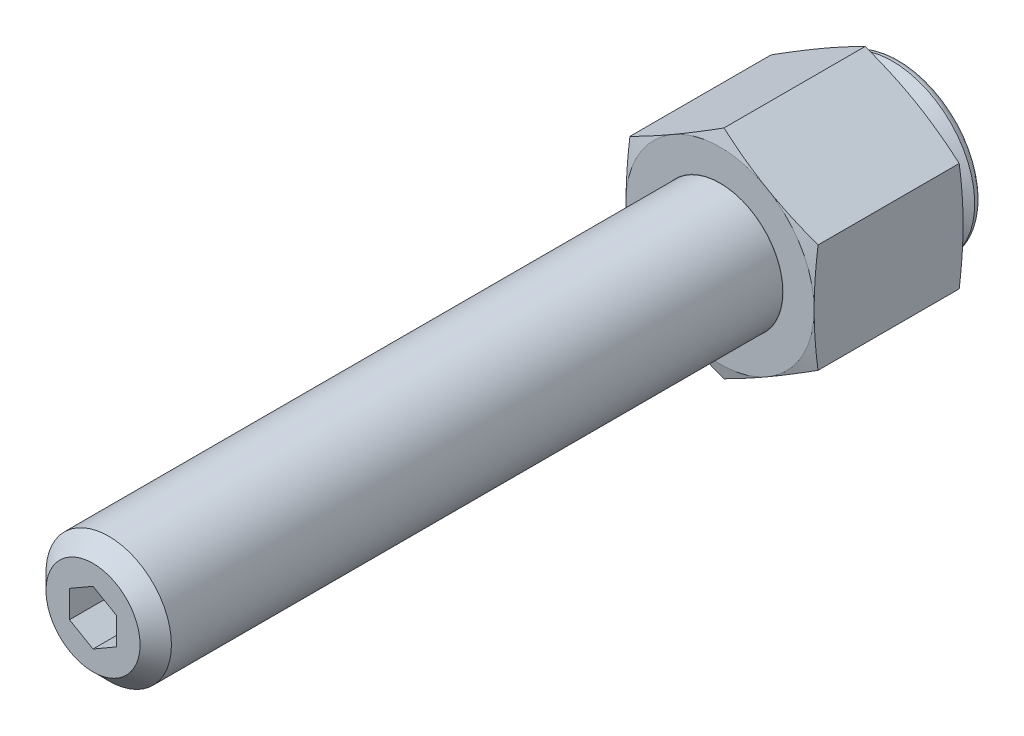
ISO-10303-21;
HEADER;
FILE_DESCRIPTION(('STEP AP214'),'2;1');
FILE_NAME('part.step','',(''),(''),'','','');
FILE_SCHEMA(('AUTOMOTIVE_DESIGN { 1 0 10303 214 1 1 1 1 }'));
ENDSEC;
DATA;
#1=APPLICATION_CONTEXT('core data for automotive mechanical design processes');
#2=APPLICATION_PROTOCOL_DEFINITION('international standard','automotive_design',2000,#1);
#3=PRODUCT_CONTEXT('',#1,'mechanical');
#4=PRODUCT('Part','Part','',(#3));
#5=PRODUCT_RELATED_PRODUCT_CATEGORY('part','',(#4));
#6=PRODUCT_DEFINITION_FORMATION('','',#4);
#7=PRODUCT_DEFINITION_CONTEXT('part definition',#1,'design');
#8=PRODUCT_DEFINITION('design','',#6,#7);
#9=PRODUCT_DEFINITION_SHAPE('','',#8);
#10=(LENGTH_UNIT() NAMED_UNIT(*) SI_UNIT(.MILLI.,.METRE.));
#11=(NAMED_UNIT(*) PLANE_ANGLE_UNIT() SI_UNIT($,.RADIAN.));
#12=(NAMED_UNIT(*) SI_UNIT($,.STERADIAN.) SOLID_ANGLE_UNIT());
#13=UNCERTAINTY_MEASURE_WITH_UNIT(LENGTH_MEASURE(1.E-05),#10,'distance_accuracy_value','');
#14=(GEOMETRIC_REPRESENTATION_CONTEXT(3) GLOBAL_UNCERTAINTY_ASSIGNED_CONTEXT((#13)) GLOBAL_UNIT_ASSIGNED_CONTEXT((#10,
#11,#12)) REPRESENTATION_CONTEXT('',''));
#15=CARTESIAN_POINT('',(0.,0.,0.));
#16=DIRECTION('',(0.,0.,1.));
#17=DIRECTION('',(1.,0.,0.));
#18=AXIS2_PLACEMENT_3D('',#15,#16,#17);
#19=CARTESIAN_POINT('',(0.,0.,5.778000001));
#20=DIRECTION('',(0.,0.,-1.));
#21=DIRECTION('',(-1.,0.,0.));
#22=AXIS2_PLACEMENT_3D('',#19,#20,#21);
#23=PLANE('',#22);
#24=CARTESIAN_POINT('',(0.,0.,5.778000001));
#25=DIRECTION('',(0.,0.,-1.));
#26=DIRECTION('',(-1.,0.,0.));
#27=AXIS2_PLACEMENT_3D('',#24,#25,#26);
#28=CIRCLE('',#27,10.0584);
#29=CARTESIAN_POINT('',(-10.0584,0.,5.778000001));
#30=VERTEX_POINT('',#29);
#31=EDGE_CURVE('E168',#30,#30,#28,.F.);
#32=ORIENTED_EDGE('',*,*,#31,.F.);
#33=EDGE_LOOP('',(#32));
#34=FACE_BOUND('',#33,.T.);
#35=CARTESIAN_POINT('',(0.,0.,5.778000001));
#36=DIRECTION('',(0.,0.,-1.));
#37=DIRECTION('',(-0.987253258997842,-0.159157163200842,0.));
#38=AXIS2_PLACEMENT_3D('',#35,#36,#37);
#39=CIRCLE('',#38,9.68719058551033);
#40=CARTESIAN_POINT('',(-1.54178577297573,9.56371047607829,5.778000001));
#41=VERTEX_POINT('',#40);
#42=EDGE_CURVE('E9',#41,#41,#39,.T.);
#43=ORIENTED_EDGE('',*,*,#42,.F.);
#44=EDGE_LOOP('',(#43));
#45=FACE_BOUND('',#44,.T.);
#46=ADVANCED_FACE('F14',(#34,#45),#23,.T.);
#47=CARTESIAN_POINT('',(-12.,20.7846096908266,23.000000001));
#48=DIRECTION('',(0.,0.,-1.));
#49=DIRECTION('',(-1.,0.,0.));
#50=AXIS2_PLACEMENT_3D('',#47,#48,#49);
#51=PLANE('',#50);
#52=CARTESIAN_POINT('',(0.,0.,23.000000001));
#53=DIRECTION('',(0.,0.,-1.));
#54=DIRECTION('',(-1.,0.,0.));
#55=AXIS2_PLACEMENT_3D('',#52,#53,#54);
#56=CIRCLE('',#55,12.);
#57=CARTESIAN_POINT('',(-12.,0.,23.000000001));
#58=VERTEX_POINT('',#57);
#59=CARTESIAN_POINT('',(-6.,10.3923048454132,23.000000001));
#60=VERTEX_POINT('',#59);
#61=EDGE_CURVE('E756',#58,#60,#56,.T.);
#62=ORIENTED_EDGE('',*,*,#61,.F.);
#63=CARTESIAN_POINT('',(0.,0.,23.000000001));
#64=DIRECTION('',(0.,0.,-1.));
#65=DIRECTION('',(-1.,0.,0.));
#66=AXIS2_PLACEMENT_3D('',#63,#64,#65);
#67=CIRCLE('',#66,12.);
#68=CARTESIAN_POINT('',(-6.,-10.3923048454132,23.000000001));
#69=VERTEX_POINT('',#68);
#70=EDGE_CURVE('E307',#69,#58,#67,.T.);
#71=ORIENTED_EDGE('',*,*,#70,.F.);
#72=CARTESIAN_POINT('',(6.,-10.3923048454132,23.000000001));
#73=VERTEX_POINT('',#72);
#74=EDGE_CURVE('E325',#73,#69,#67,.T.);
#75=ORIENTED_EDGE('',*,*,#74,.F.);
#76=CARTESIAN_POINT('',(12.,0.,23.000000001));
#77=VERTEX_POINT('',#76);
#78=EDGE_CURVE('E814',#77,#73,#67,.T.);
#79=ORIENTED_EDGE('',*,*,#78,.F.);
#80=CARTESIAN_POINT('',(6.,10.3923048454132,23.000000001));
#81=VERTEX_POINT('',#80);
#82=EDGE_CURVE('E809',#81,#77,#67,.T.);
#83=ORIENTED_EDGE('',*,*,#82,.F.);
#84=EDGE_CURVE('E326',#60,#81,#67,.T.);
#85=ORIENTED_EDGE('',*,*,#84,.F.);
#86=EDGE_LOOP('',(#62,#71,#75,#79,#83,#85));
#87=FACE_BOUND('',#86,.T.);
#88=CARTESIAN_POINT('',(0.,0.,23.000000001));
#89=DIRECTION('',(0.,0.,-1.));
#90=DIRECTION('',(-1.,0.,0.));
#91=AXIS2_PLACEMENT_3D('',#88,#89,#90);
#92=CIRCLE('',#91,8.0518);
#93=CARTESIAN_POINT('',(-8.0518,0.,23.000000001));
#94=VERTEX_POINT('',#93);
#95=EDGE_CURVE('E338',#94,#94,#92,.T.);
#96=ORIENTED_EDGE('',*,*,#95,.T.);
#97=EDGE_LOOP('',(#96));
#98=FACE_BOUND('',#97,.T.);
#99=ADVANCED_FACE('F660',(#87,#98),#51,.F.);
#100=CARTESIAN_POINT('',(-12.,-6.92820323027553,23.000000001));
#101=DIRECTION('',(-1.,0.,0.));
#102=DIRECTION('',(0.,1.,0.));
#103=AXIS2_PLACEMENT_3D('',#100,#101,#102);
#104=PLANE('',#103);
#105=DIRECTION('',(0.,0.,-1.));
#106=VECTOR('',#105,1.);
#107=CARTESIAN_POINT('',(-12.,6.92820323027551,23.000000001));
#108=LINE('',#107,#106);
#109=CARTESIAN_POINT('',(-12.,6.92820323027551,22.5025773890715));
#110=VERTEX_POINT('',#109);
#111=CARTESIAN_POINT('',(-12.,6.92820323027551,4.49742261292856));
#112=VERTEX_POINT('',#111);
#113=EDGE_CURVE('E320',#110,#112,#108,.T.);
#114=ORIENTED_EDGE('',*,*,#113,.T.);
#115=CARTESIAN_POINT('',(-12.,-18.3832707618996,6.66696199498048));
#116=CARTESIAN_POINT('',(-12.,-17.8382256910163,6.54469958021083));
#117=CARTESIAN_POINT('',(-12.,-17.292841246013,6.42392316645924));
#118=CARTESIAN_POINT('',(-12.,-16.2012268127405,6.18614454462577));
#119=CARTESIAN_POINT('',(-12.,-15.6549967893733,6.06914249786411));
#120=CARTESIAN_POINT('',(-12.,-14.5610430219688,5.83961463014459));
#121=CARTESIAN_POINT('',(-12.,-14.0133183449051,5.72709324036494));
#122=CARTESIAN_POINT('',(-12.,-12.9167329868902,5.50773233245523));
#123=CARTESIAN_POINT('',(-12.,-12.3678723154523,5.40089276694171));
#124=CARTESIAN_POINT('',(-12.,-11.2731971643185,5.19507382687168));
#125=CARTESIAN_POINT('',(-12.,-10.7273932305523,5.09603863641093));
#126=CARTESIAN_POINT('',(-12.,-9.63428575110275,4.90655103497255));
#127=CARTESIAN_POINT('',(-12.,-9.08698219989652,4.81609865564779));
#128=CARTESIAN_POINT('',(-12.,-7.99078335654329,4.64580548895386));
#129=CARTESIAN_POINT('',(-12.,-7.441888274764,4.56596335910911));
#130=CARTESIAN_POINT('',(-12.,-6.34234963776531,4.41923202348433));
#131=CARTESIAN_POINT('',(-12.,-5.79170608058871,4.35234283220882));
#132=CARTESIAN_POINT('',(-12.,-4.682434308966,4.23339918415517));
#133=CARTESIAN_POINT('',(-12.,-4.12378671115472,4.18152282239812));
#134=CARTESIAN_POINT('',(-12.,-3.00507508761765,4.09617622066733));
#135=CARTESIAN_POINT('',(-12.,-2.44501109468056,4.06270555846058));
#136=CARTESIAN_POINT('',(-12.,-1.32428091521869,4.01612183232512));
#137=CARTESIAN_POINT('',(-12.,-0.763615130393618,4.00299929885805));
#138=CARTESIAN_POINT('',(-12.,0.357813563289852,3.99791989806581));
#139=CARTESIAN_POINT('',(-12.,0.918576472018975,4.00596300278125));
#140=CARTESIAN_POINT('',(-12.,2.0414601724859,4.04276323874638));
#141=CARTESIAN_POINT('',(-12.,2.60357843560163,4.07159597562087));
#142=CARTESIAN_POINT('',(-12.,3.72650038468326,4.14832476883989));
#143=CARTESIAN_POINT('',(-12.,4.28730404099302,4.19622125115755));
#144=CARTESIAN_POINT('',(-12.,5.40759098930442,4.30864437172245));
#145=CARTESIAN_POINT('',(-12.,5.96707316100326,4.37318200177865));
#146=CARTESIAN_POINT('',(-12.,7.0842347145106,4.51618489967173));
#147=CARTESIAN_POINT('',(-12.,7.64191409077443,4.59465021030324));
#148=CARTESIAN_POINT('',(-12.,8.72392663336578,4.75820525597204));
#149=CARTESIAN_POINT('',(-12.,9.24835581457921,4.84266617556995));
#150=CARTESIAN_POINT('',(-12.,10.2958159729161,5.01989303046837));
#151=CARTESIAN_POINT('',(-12.,10.8188469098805,5.11265920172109));
#152=CARTESIAN_POINT('',(-12.,11.8637124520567,5.30496510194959));
#153=CARTESIAN_POINT('',(-12.,12.3855469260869,5.40450554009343));
#154=CARTESIAN_POINT('',(-12.,13.4281250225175,5.60909869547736));
#155=CARTESIAN_POINT('',(-12.,13.9488686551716,5.71415136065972));
#156=CARTESIAN_POINT('',(-12.,14.989554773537,5.92879012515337));
#157=CARTESIAN_POINT('',(-12.,15.5094970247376,6.03837735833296));
#158=CARTESIAN_POINT('',(-12.,16.5485863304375,6.26126449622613));
#159=CARTESIAN_POINT('',(-12.,17.0677333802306,6.37456442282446));
#160=CARTESIAN_POINT('',(-12.,18.6240890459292,6.71902172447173));
#161=CARTESIAN_POINT('',(-12.,19.660285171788,6.95475187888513));
#162=CARTESIAN_POINT('',(-12.,21.7204356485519,7.43231222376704));
#163=CARTESIAN_POINT('',(-12.,22.7444095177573,7.67405876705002));
#164=CARTESIAN_POINT('',(-12.,24.7909351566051,8.16357208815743));
#165=CARTESIAN_POINT('',(-12.,25.8134868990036,8.41133897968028));
#166=CARTESIAN_POINT('',(-12.,27.8562043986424,8.91100461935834));
#167=CARTESIAN_POINT('',(-12.,28.8763715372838,9.16289773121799));
#168=CARTESIAN_POINT('',(-12.,30.4059760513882,9.54325987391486));
#169=CARTESIAN_POINT('',(-12.,30.9157281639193,9.67046555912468));
#170=CARTESIAN_POINT('',(-12.,31.9350454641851,9.9256214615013));
#171=CARTESIAN_POINT('',(-12.,32.4446106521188,10.0535716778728));
#172=CARTESIAN_POINT('',(-12.,32.9540943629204,10.1818454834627));
#173=B_SPLINE_CURVE_WITH_KNOTS('',3,(#115,#116,#117,#118,#119,#120,#121,#122,#123,#124,#125,
#126,#127,#128,#129,#130,#131,#132,#133,#134,#135,#136,#137,#138,#139,#140,#141,#142,#143,#144,
#145,#146,#147,#148,#149,#150,#151,#152,#153,#154,#155,#156,#157,#158,#159,#160,#161,#162,#163,
#164,#165,#166,#167,#168,#169,#170,#171,#172),.UNSPECIFIED.,.F.,.F.,(4,2,2,2,2,2,2,2,2,2,2,2,2,
2,2,2,2,2,2,2,2,2,2,2,2,2,2,2,4),(0.,1.67577524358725,3.35162201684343,5.02908693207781,
6.70653785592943,8.37063128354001,10.0347308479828,11.6986196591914,13.3625103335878,
15.0453984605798,16.7282479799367,18.4103141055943,20.0923780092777,21.7805901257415,
23.4688399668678,25.1582077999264,26.8475808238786,28.4410626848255,30.034589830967,
31.6282840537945,33.2219632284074,34.8160433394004,36.4101328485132,39.5980881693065,
42.7544374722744,45.9108464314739,49.0632539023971,50.6394059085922,52.2155562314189),.UNSPECIFIED.);
#174=CARTESIAN_POINT('',(-12.,0.,4.000000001));
#175=VERTEX_POINT('',#174);
#176=EDGE_CURVE('E766',#112,#175,#173,.F.);
#177=ORIENTED_EDGE('',*,*,#176,.T.);
#178=CARTESIAN_POINT('',(-12.,-6.92820323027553,4.49742261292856));
#179=VERTEX_POINT('',#178);
#180=EDGE_CURVE('E263',#175,#179,#173,.F.);
#181=ORIENTED_EDGE('',*,*,#180,.T.);
#182=DIRECTION('',(0.,0.,-1.));
#183=VECTOR('',#182,1.);
#184=CARTESIAN_POINT('',(-12.,-6.92820323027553,23.000000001));
#185=LINE('',#184,#183);
#186=CARTESIAN_POINT('',(-12.,-6.92820323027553,22.5025773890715));
#187=VERTEX_POINT('',#186);
#188=EDGE_CURVE('E304',#187,#179,#185,.T.);
#189=ORIENTED_EDGE('',*,*,#188,.F.);
#190=CARTESIAN_POINT('',(-12.,-18.3832707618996,20.3330380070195));
#191=CARTESIAN_POINT('',(-12.,-17.8382256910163,20.4553004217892));
#192=CARTESIAN_POINT('',(-12.,-17.292841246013,20.5760768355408));
#193=CARTESIAN_POINT('',(-12.,-16.2012268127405,20.8138554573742));
#194=CARTESIAN_POINT('',(-12.,-15.6549967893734,20.9308575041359));
#195=CARTESIAN_POINT('',(-12.,-14.5610430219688,21.1603853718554));
#196=CARTESIAN_POINT('',(-12.,-14.0133183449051,21.2729067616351));
#197=CARTESIAN_POINT('',(-12.,-12.9167329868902,21.4922676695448));
#198=CARTESIAN_POINT('',(-12.,-12.3678723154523,21.5991072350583));
#199=CARTESIAN_POINT('',(-12.,-11.2731971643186,21.8049261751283));
#200=CARTESIAN_POINT('',(-12.,-10.7273932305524,21.9039613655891));
#201=CARTESIAN_POINT('',(-12.,-9.63428575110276,22.0934489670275));
#202=CARTESIAN_POINT('',(-12.,-9.08698219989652,22.1839013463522));
#203=CARTESIAN_POINT('',(-12.,-7.9907833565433,22.3541945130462));
#204=CARTESIAN_POINT('',(-12.,-7.441888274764,22.4340366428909));
#205=CARTESIAN_POINT('',(-12.,-6.34234963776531,22.5807679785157));
#206=CARTESIAN_POINT('',(-12.,-5.79170608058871,22.6476571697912));
#207=CARTESIAN_POINT('',(-12.,-4.682434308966,22.7666008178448));
#208=CARTESIAN_POINT('',(-12.,-4.12378671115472,22.8184771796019));
#209=CARTESIAN_POINT('',(-12.,-3.00507508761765,22.9038237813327));
#210=CARTESIAN_POINT('',(-12.,-2.44501109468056,22.9372944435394));
#211=CARTESIAN_POINT('',(-12.,-1.32428091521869,22.9838781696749));
#212=CARTESIAN_POINT('',(-12.,-0.763615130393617,22.997000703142));
#213=CARTESIAN_POINT('',(-12.,0.357813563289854,23.0020801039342));
#214=CARTESIAN_POINT('',(-12.,0.918576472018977,22.9940369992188));
#215=CARTESIAN_POINT('',(-12.,2.0414601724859,22.9572367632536));
#216=CARTESIAN_POINT('',(-12.,2.60357843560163,22.9284040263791));
#217=CARTESIAN_POINT('',(-12.,3.72650038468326,22.8516752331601));
#218=CARTESIAN_POINT('',(-12.,4.28730404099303,22.8037787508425));
#219=CARTESIAN_POINT('',(-12.,5.40759098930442,22.6913556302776));
#220=CARTESIAN_POINT('',(-12.,5.96707316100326,22.6268180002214));
#221=CARTESIAN_POINT('',(-12.,7.08423471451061,22.4838151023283));
#222=CARTESIAN_POINT('',(-12.,7.64191409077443,22.4053497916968));
#223=CARTESIAN_POINT('',(-12.,8.72392663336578,22.241794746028));
#224=CARTESIAN_POINT('',(-12.,9.24835581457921,22.1573338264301));
#225=CARTESIAN_POINT('',(-12.,10.2958159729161,21.9801069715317));
#226=CARTESIAN_POINT('',(-12.,10.8188469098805,21.8873408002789));
#227=CARTESIAN_POINT('',(-12.,11.8637124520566,21.6950349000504));
#228=CARTESIAN_POINT('',(-12.,12.3855469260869,21.5954944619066));
#229=CARTESIAN_POINT('',(-12.,13.4281250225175,21.3909013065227));
#230=CARTESIAN_POINT('',(-12.,13.9488686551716,21.2858486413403));
#231=CARTESIAN_POINT('',(-12.,14.989554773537,21.0712098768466));
#232=CARTESIAN_POINT('',(-12.,15.5094970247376,20.961622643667));
#233=CARTESIAN_POINT('',(-12.,16.5485863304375,20.7387355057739));
#234=CARTESIAN_POINT('',(-12.,17.0677333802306,20.6254355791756));
#235=CARTESIAN_POINT('',(-12.,18.6240890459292,20.2809782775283));
#236=CARTESIAN_POINT('',(-12.,19.660285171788,20.0452481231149));
#237=CARTESIAN_POINT('',(-12.,21.7204356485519,19.567687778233));
#238=CARTESIAN_POINT('',(-12.,22.7444095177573,19.32594123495));
#239=CARTESIAN_POINT('',(-12.,24.7909351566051,18.8364279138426));
#240=CARTESIAN_POINT('',(-12.,25.8134868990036,18.5886610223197));
#241=CARTESIAN_POINT('',(-12.,27.8562043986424,18.0889953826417));
#242=CARTESIAN_POINT('',(-12.,28.8763715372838,17.837102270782));
#243=CARTESIAN_POINT('',(-12.,30.4059760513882,17.4567401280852));
#244=CARTESIAN_POINT('',(-12.,30.9157281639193,17.3295344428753));
#245=CARTESIAN_POINT('',(-12.,31.9350454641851,17.0743785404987));
#246=CARTESIAN_POINT('',(-12.,32.4446106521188,16.9464283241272));
#247=CARTESIAN_POINT('',(-12.,32.9540943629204,16.8181545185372));
#248=B_SPLINE_CURVE_WITH_KNOTS('',3,(#190,#191,#192,#193,#194,#195,#196,#197,#198,#199,#200,
#201,#202,#203,#204,#205,#206,#207,#208,#209,#210,#211,#212,#213,#214,#215,#216,#217,#218,#219,
#220,#221,#222,#223,#224,#225,#226,#227,#228,#229,#230,#231,#232,#233,#234,#235,#236,#237,#238,
#239,#240,#241,#242,#243,#244,#245,#246,#247),.UNSPECIFIED.,.F.,.F.,(4,2,2,2,2,2,2,2,2,2,2,2,2,
2,2,2,2,2,2,2,2,2,2,2,2,2,2,2,4),(0.,1.67577524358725,3.35162201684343,5.02908693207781,
6.70653785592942,8.37063128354,10.0347308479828,11.6986196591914,13.3625103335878,
15.0453984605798,16.7282479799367,18.4103141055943,20.0923780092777,21.7805901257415,
23.4688399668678,25.1582077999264,26.8475808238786,28.4410626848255,30.034589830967,
31.6282840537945,33.2219632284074,34.8160433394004,36.4101328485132,39.5980881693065,
42.7544374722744,45.9108464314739,49.0632539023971,50.6394059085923,52.2155562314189),.UNSPECIFIED.);
#249=EDGE_CURVE('E769',#187,#58,#248,.T.);
#250=ORIENTED_EDGE('',*,*,#249,.T.);
#251=EDGE_CURVE('E770',#58,#110,#248,.T.);
#252=ORIENTED_EDGE('',*,*,#251,.T.);
#253=EDGE_LOOP('',(#114,#177,#181,#189,#250,#252));
#254=FACE_BOUND('',#253,.T.);
#255=ADVANCED_FACE('F274',(#254),#104,.T.);
#256=CARTESIAN_POINT('',(0.,-13.856406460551,23.000000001));
#257=DIRECTION('',(-0.5,-0.866025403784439,0.));
#258=DIRECTION('',(-0.866025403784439,0.5,0.));
#259=AXIS2_PLACEMENT_3D('',#256,#257,#258);
#260=PLANE('',#259);
#261=ORIENTED_EDGE('',*,*,#188,.T.);
#262=CARTESIAN_POINT('',(-12.0002,-6.92808776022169,4.49745355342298));
#263=CARTESIAN_POINT('',(-11.5018535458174,-7.2158082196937,4.42032798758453));
#264=CARTESIAN_POINT('',(-11.0026035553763,-7.50405033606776,4.3503107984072));
#265=CARTESIAN_POINT('',(-10.0023405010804,-8.08155247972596,4.2272972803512));
#266=CARTESIAN_POINT('',(-9.50132680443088,-8.37081287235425,4.17430786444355));
#267=CARTESIAN_POINT('',(-8.50057386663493,-8.94859785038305,4.08844327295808));
#268=CARTESIAN_POINT('',(-8.00084139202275,-9.23711852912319,4.05546570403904));
#269=CARTESIAN_POINT('',(-7.00073918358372,-9.8145278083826,4.01124617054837));
#270=CARTESIAN_POINT('',(-6.50036959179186,-10.1034163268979,4.000000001));
#271=CARTESIAN_POINT('',(-5.49963040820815,-10.6811933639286,4.000000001));
#272=CARTESIAN_POINT('',(-4.99926081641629,-10.9700818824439,4.01124617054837));
#273=CARTESIAN_POINT('',(-3.99915860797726,-11.5474911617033,4.05546570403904));
#274=CARTESIAN_POINT('',(-3.49942613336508,-11.8360118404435,4.08844327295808));
#275=CARTESIAN_POINT('',(-2.49867319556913,-12.4137968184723,4.17430786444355));
#276=CARTESIAN_POINT('',(-1.9976594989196,-12.7030572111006,4.2272972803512));
#277=CARTESIAN_POINT('',(-0.997396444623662,-13.2805593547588,4.3503107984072));
#278=CARTESIAN_POINT('',(-0.49814645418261,-13.5688014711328,4.42032798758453));
#279=CARTESIAN_POINT('',(0.000199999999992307,-13.8565219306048,4.49745355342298));
#280=B_SPLINE_CURVE_WITH_KNOTS('',3,(#262,#263,#264,#265,#266,#267,#268,#269,#270,#271,#272,
#273,#274,#275,#276,#277,#278,#279),.UNSPECIFIED.,.F.,.F.,(4,2,2,2,2,2,2,2,4),(0.,
1.74185054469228,3.48440735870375,5.21797126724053,6.95119970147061,8.68442813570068,
10.4179920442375,12.1605488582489,13.9023994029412),.UNSPECIFIED.);
#281=CARTESIAN_POINT('',(-6.,-10.3923048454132,4.000000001));
#282=VERTEX_POINT('',#281);
#283=EDGE_CURVE('E261',#179,#282,#280,.T.);
#284=ORIENTED_EDGE('',*,*,#283,.T.);
#285=CARTESIAN_POINT('',(0.,-13.856406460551,4.49742261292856));
#286=VERTEX_POINT('',#285);
#287=EDGE_CURVE('E254',#282,#286,#280,.T.);
#288=ORIENTED_EDGE('',*,*,#287,.T.);
#289=DIRECTION('',(0.,0.,-1.));
#290=VECTOR('',#289,1.);
#291=CARTESIAN_POINT('',(0.,-13.856406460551,23.000000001));
#292=LINE('',#291,#290);
#293=CARTESIAN_POINT('',(0.,-13.856406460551,22.5025773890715));
#294=VERTEX_POINT('',#293);
#295=EDGE_CURVE('E308',#294,#286,#292,.T.);
#296=ORIENTED_EDGE('',*,*,#295,.F.);
#297=CARTESIAN_POINT('',(0.000199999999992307,-13.8565219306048,22.502546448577));
#298=CARTESIAN_POINT('',(-0.498146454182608,-13.5688014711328,22.5796720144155));
#299=CARTESIAN_POINT('',(-0.997396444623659,-13.2805593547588,22.6496892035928));
#300=CARTESIAN_POINT('',(-1.9976594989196,-12.7030572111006,22.7727027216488));
#301=CARTESIAN_POINT('',(-2.49867319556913,-12.4137968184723,22.8256921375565));
#302=CARTESIAN_POINT('',(-3.49942613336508,-11.8360118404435,22.9115567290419));
#303=CARTESIAN_POINT('',(-3.99915860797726,-11.5474911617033,22.944534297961));
#304=CARTESIAN_POINT('',(-4.99926081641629,-10.9700818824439,22.9887538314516));
#305=CARTESIAN_POINT('',(-5.49963040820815,-10.6811933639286,23.000000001));
#306=CARTESIAN_POINT('',(-6.50036959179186,-10.1034163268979,23.000000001));
#307=CARTESIAN_POINT('',(-7.00073918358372,-9.8145278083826,22.9887538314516));
#308=CARTESIAN_POINT('',(-8.00084139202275,-9.23711852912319,22.944534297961));
#309=CARTESIAN_POINT('',(-8.50057386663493,-8.94859785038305,22.9115567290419));
#310=CARTESIAN_POINT('',(-9.50132680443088,-8.37081287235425,22.8256921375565));
#311=CARTESIAN_POINT('',(-10.0023405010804,-8.08155247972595,22.7727027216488));
#312=CARTESIAN_POINT('',(-11.0026035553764,-7.50405033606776,22.6496892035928));
#313=CARTESIAN_POINT('',(-11.5018535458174,-7.2158082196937,22.5796720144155));
#314=CARTESIAN_POINT('',(-12.0002,-6.92808776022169,22.502546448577));
#315=B_SPLINE_CURVE_WITH_KNOTS('',3,(#297,#298,#299,#300,#301,#302,#303,#304,#305,#306,#307,
#308,#309,#310,#311,#312,#313,#314),.UNSPECIFIED.,.F.,.F.,(4,2,2,2,2,2,2,2,4),(0.,
1.74185054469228,3.48440735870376,5.21797126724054,6.95119970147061,8.68442813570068,
10.4179920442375,12.1605488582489,13.9023994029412),.UNSPECIFIED.);
#316=EDGE_CURVE('E288',#294,#69,#315,.T.);
#317=ORIENTED_EDGE('',*,*,#316,.T.);
#318=EDGE_CURVE('E280',#69,#187,#315,.T.);
#319=ORIENTED_EDGE('',*,*,#318,.T.);
#320=EDGE_LOOP('',(#261,#284,#288,#296,#317,#319));
#321=FACE_BOUND('',#320,.T.);
#322=ADVANCED_FACE('F269',(#321),#260,.T.);
#323=CARTESIAN_POINT('',(12.,-6.92820323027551,23.000000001));
#324=DIRECTION('',(0.5,-0.866025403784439,0.));
#325=DIRECTION('',(-0.866025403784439,-0.5,0.));
#326=AXIS2_PLACEMENT_3D('',#323,#324,#325);
#327=PLANE('',#326);
#328=ORIENTED_EDGE('',*,*,#295,.T.);
#329=CARTESIAN_POINT('',(-0.000200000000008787,-13.8565219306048,4.49745355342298));
#330=CARTESIAN_POINT('',(0.498146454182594,-13.5688014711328,4.42032798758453));
#331=CARTESIAN_POINT('',(0.997396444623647,-13.2805593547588,4.3503107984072));
#332=CARTESIAN_POINT('',(1.99765949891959,-12.7030572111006,4.2272972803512));
#333=CARTESIAN_POINT('',(2.49867319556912,-12.4137968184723,4.17430786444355));
#334=CARTESIAN_POINT('',(3.49942613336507,-11.8360118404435,4.08844327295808));
#335=CARTESIAN_POINT('',(3.99915860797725,-11.5474911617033,4.05546570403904));
#336=CARTESIAN_POINT('',(4.99926081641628,-10.9700818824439,4.01124617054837));
#337=CARTESIAN_POINT('',(5.49963040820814,-10.6811933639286,4.000000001));
#338=CARTESIAN_POINT('',(6.50036959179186,-10.1034163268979,4.000000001));
#339=CARTESIAN_POINT('',(7.00073918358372,-9.8145278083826,4.01124617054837));
#340=CARTESIAN_POINT('',(8.00084139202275,-9.23711852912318,4.05546570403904));
#341=CARTESIAN_POINT('',(8.50057386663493,-8.94859785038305,4.08844327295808));
#342=CARTESIAN_POINT('',(9.50132680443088,-8.37081287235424,4.17430786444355));
#343=CARTESIAN_POINT('',(10.0023405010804,-8.08155247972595,4.2272972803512));
#344=CARTESIAN_POINT('',(11.0026035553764,-7.50405033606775,4.3503107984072));
#345=CARTESIAN_POINT('',(11.5018535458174,-7.21580821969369,4.42032798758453));
#346=CARTESIAN_POINT('',(12.0002,-6.92808776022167,4.49745355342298));
#347=B_SPLINE_CURVE_WITH_KNOTS('',3,(#329,#330,#331,#332,#333,#334,#335,#336,#337,#338,#339,
#340,#341,#342,#343,#344,#345,#346),.UNSPECIFIED.,.F.,.F.,(4,2,2,2,2,2,2,2,4),(0.,
1.74185054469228,3.48440735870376,5.21797126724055,6.95119970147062,8.68442813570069,
10.4179920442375,12.160548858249,13.9023994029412),.UNSPECIFIED.);
#348=CARTESIAN_POINT('',(6.,-10.3923048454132,4.000000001));
#349=VERTEX_POINT('',#348);
#350=EDGE_CURVE('E262',#286,#349,#347,.T.);
#351=ORIENTED_EDGE('',*,*,#350,.T.);
#352=CARTESIAN_POINT('',(12.,-6.92820323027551,4.49742261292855));
#353=VERTEX_POINT('',#352);
#354=EDGE_CURVE('E247',#349,#353,#347,.T.);
#355=ORIENTED_EDGE('',*,*,#354,.T.);
#356=DIRECTION('',(0.,0.,-1.));
#357=VECTOR('',#356,1.);
#358=CARTESIAN_POINT('',(12.,-6.92820323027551,23.000000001));
#359=LINE('',#358,#357);
#360=CARTESIAN_POINT('',(12.,-6.92820323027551,22.5025773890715));
#361=VERTEX_POINT('',#360);
#362=EDGE_CURVE('E311',#361,#353,#359,.T.);
#363=ORIENTED_EDGE('',*,*,#362,.F.);
#364=CARTESIAN_POINT('',(12.0002,-6.92808776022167,22.502546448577));
#365=CARTESIAN_POINT('',(11.5018535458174,-7.21580821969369,22.5796720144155));
#366=CARTESIAN_POINT('',(11.0026035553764,-7.50405033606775,22.6496892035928));
#367=CARTESIAN_POINT('',(10.0023405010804,-8.08155247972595,22.7727027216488));
#368=CARTESIAN_POINT('',(9.50132680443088,-8.37081287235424,22.8256921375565));
#369=CARTESIAN_POINT('',(8.50057386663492,-8.94859785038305,22.9115567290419));
#370=CARTESIAN_POINT('',(8.00084139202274,-9.23711852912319,22.944534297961));
#371=CARTESIAN_POINT('',(7.00073918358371,-9.8145278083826,22.9887538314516));
#372=CARTESIAN_POINT('',(6.50036959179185,-10.1034163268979,23.000000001));
#373=CARTESIAN_POINT('',(5.49963040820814,-10.6811933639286,23.000000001));
#374=CARTESIAN_POINT('',(4.99926081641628,-10.9700818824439,22.9887538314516));
#375=CARTESIAN_POINT('',(3.99915860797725,-11.5474911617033,22.944534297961));
#376=CARTESIAN_POINT('',(3.49942613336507,-11.8360118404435,22.9115567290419));
#377=CARTESIAN_POINT('',(2.49867319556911,-12.4137968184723,22.8256921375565));
#378=CARTESIAN_POINT('',(1.99765949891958,-12.7030572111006,22.7727027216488));
#379=CARTESIAN_POINT('',(0.997396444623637,-13.2805593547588,22.6496892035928));
#380=CARTESIAN_POINT('',(0.498146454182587,-13.5688014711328,22.5796720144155));
#381=CARTESIAN_POINT('',(-0.000200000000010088,-13.8565219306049,22.502546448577));
#382=B_SPLINE_CURVE_WITH_KNOTS('',3,(#364,#365,#366,#367,#368,#369,#370,#371,#372,#373,#374,
#375,#376,#377,#378,#379,#380,#381),.UNSPECIFIED.,.F.,.F.,(4,2,2,2,2,2,2,2,4),(0.,
1.74185054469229,3.48440735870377,5.21797126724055,6.95119970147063,8.6844281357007,
10.4179920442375,12.160548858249,13.9023994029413),.UNSPECIFIED.);
#383=EDGE_CURVE('E302',#361,#73,#382,.T.);
#384=ORIENTED_EDGE('',*,*,#383,.T.);
#385=EDGE_CURVE('E295',#73,#294,#382,.T.);
#386=ORIENTED_EDGE('',*,*,#385,.T.);
#387=EDGE_LOOP('',(#328,#351,#355,#363,#384,#386));
#388=FACE_BOUND('',#387,.T.);
#389=ADVANCED_FACE('F273',(#388),#327,.T.);
#390=CARTESIAN_POINT('',(12.,6.92820323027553,23.000000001));
#391=DIRECTION('',(1.,0.,0.));
#392=DIRECTION('',(0.,-1.,0.));
#393=AXIS2_PLACEMENT_3D('',#390,#391,#392);
#394=PLANE('',#393);
#395=ORIENTED_EDGE('',*,*,#362,.T.);
#396=CARTESIAN_POINT('',(12.,-18.3832707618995,6.66696199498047));
#397=CARTESIAN_POINT('',(12.,-17.8382256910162,6.54469958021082));
#398=CARTESIAN_POINT('',(12.,-17.2928412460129,6.42392316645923));
#399=CARTESIAN_POINT('',(12.,-16.2012268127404,6.18614454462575));
#400=CARTESIAN_POINT('',(12.,-15.6549967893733,6.0691424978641));
#401=CARTESIAN_POINT('',(12.,-14.5610430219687,5.83961463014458));
#402=CARTESIAN_POINT('',(12.,-14.013318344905,5.72709324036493));
#403=CARTESIAN_POINT('',(12.,-12.9167329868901,5.50773233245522));
#404=CARTESIAN_POINT('',(12.,-12.3678723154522,5.4008927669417));
#405=CARTESIAN_POINT('',(12.,-11.2731971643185,5.19507382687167));
#406=CARTESIAN_POINT('',(12.,-10.7273932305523,5.09603863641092));
#407=CARTESIAN_POINT('',(12.,-9.6342857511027,4.90655103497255));
#408=CARTESIAN_POINT('',(12.,-9.08698219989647,4.81609865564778));
#409=CARTESIAN_POINT('',(12.,-7.99078335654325,4.64580548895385));
#410=CARTESIAN_POINT('',(12.,-7.44188827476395,4.5659633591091));
#411=CARTESIAN_POINT('',(12.,-6.34234963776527,4.41923202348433));
#412=CARTESIAN_POINT('',(12.,-5.79170608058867,4.35234283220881));
#413=CARTESIAN_POINT('',(12.,-4.68243430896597,4.23339918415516));
#414=CARTESIAN_POINT('',(12.,-4.12378671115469,4.18152282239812));
#415=CARTESIAN_POINT('',(12.,-3.00507508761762,4.09617622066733));
#416=CARTESIAN_POINT('',(12.,-2.44501109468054,4.06270555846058));
#417=CARTESIAN_POINT('',(12.,-1.32428091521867,4.01612183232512));
#418=CARTESIAN_POINT('',(12.,-0.763615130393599,4.00299929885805));
#419=CARTESIAN_POINT('',(12.,0.357813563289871,3.99791989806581));
#420=CARTESIAN_POINT('',(12.,0.918576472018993,4.00596300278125));
#421=CARTESIAN_POINT('',(12.,2.04146017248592,4.04276323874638));
#422=CARTESIAN_POINT('',(12.,2.60357843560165,4.07159597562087));
#423=CARTESIAN_POINT('',(12.,3.72650038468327,4.14832476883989));
#424=CARTESIAN_POINT('',(12.,4.28730404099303,4.19622125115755));
#425=CARTESIAN_POINT('',(12.,5.40759098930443,4.30864437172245));
#426=CARTESIAN_POINT('',(12.,5.96707316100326,4.37318200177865));
#427=CARTESIAN_POINT('',(12.,7.08423471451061,4.51618489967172));
#428=CARTESIAN_POINT('',(12.,7.64191409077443,4.59465021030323));
#429=CARTESIAN_POINT('',(12.,8.72392663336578,4.75820525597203));
#430=CARTESIAN_POINT('',(12.,9.24835581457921,4.84266617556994));
#431=CARTESIAN_POINT('',(12.,10.2958159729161,5.01989303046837));
#432=CARTESIAN_POINT('',(12.,10.8188469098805,5.11265920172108));
#433=CARTESIAN_POINT('',(12.,11.8637124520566,5.30496510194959));
#434=CARTESIAN_POINT('',(12.,12.3855469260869,5.40450554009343));
#435=CARTESIAN_POINT('',(12.,13.4281250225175,5.60909869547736));
#436=CARTESIAN_POINT('',(12.,13.9488686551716,5.71415136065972));
#437=CARTESIAN_POINT('',(12.,14.989554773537,5.92879012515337));
#438=CARTESIAN_POINT('',(12.,15.5094970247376,6.03837735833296));
#439=CARTESIAN_POINT('',(12.,16.5485863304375,6.26126449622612));
#440=CARTESIAN_POINT('',(12.,17.0677333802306,6.37456442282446));
#441=CARTESIAN_POINT('',(12.,18.6240890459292,6.71902172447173));
#442=CARTESIAN_POINT('',(12.,19.660285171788,6.95475187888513));
#443=CARTESIAN_POINT('',(12.,21.7204356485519,7.43231222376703));
#444=CARTESIAN_POINT('',(12.,22.7444095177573,7.67405876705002));
#445=CARTESIAN_POINT('',(12.,24.7909351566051,8.16357208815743));
#446=CARTESIAN_POINT('',(12.,25.8134868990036,8.41133897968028));
#447=CARTESIAN_POINT('',(12.,27.8562043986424,8.91100461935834));
#448=CARTESIAN_POINT('',(12.,28.8763715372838,9.16289773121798));
#449=CARTESIAN_POINT('',(12.,30.4059760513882,9.54325987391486));
#450=CARTESIAN_POINT('',(12.,30.9157281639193,9.67046555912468));
#451=CARTESIAN_POINT('',(12.,31.9350454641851,9.9256214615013));
#452=CARTESIAN_POINT('',(12.,32.4446106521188,10.0535716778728));
#453=CARTESIAN_POINT('',(12.,32.9540943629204,10.1818454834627));
#454=B_SPLINE_CURVE_WITH_KNOTS('',3,(#396,#397,#398,#399,#400,#401,#402,#403,#404,#405,#406,
#407,#408,#409,#410,#411,#412,#413,#414,#415,#416,#417,#418,#419,#420,#421,#422,#423,#424,#425,
#426,#427,#428,#429,#430,#431,#432,#433,#434,#435,#436,#437,#438,#439,#440,#441,#442,#443,#444,
#445,#446,#447,#448,#449,#450,#451,#452,#453),.UNSPECIFIED.,.F.,.F.,(4,2,2,2,2,2,2,2,2,2,2,2,2,
2,2,2,2,2,2,2,2,2,2,2,2,2,2,2,4),(0.,1.67577524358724,3.35162201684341,5.02908693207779,
6.70653785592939,8.37063128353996,10.0347308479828,11.6986196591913,13.3625103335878,
15.0453984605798,16.7282479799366,18.4103141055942,20.0923780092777,21.7805901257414,
23.4688399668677,25.1582077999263,26.8475808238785,28.4410626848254,30.0345898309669,
31.6282840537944,33.2219632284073,34.8160433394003,36.4101328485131,39.5980881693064,
42.7544374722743,45.9108464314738,49.063253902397,50.6394059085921,52.2155562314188),.UNSPECIFIED.);
#455=CARTESIAN_POINT('',(12.,0.,4.000000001));
#456=VERTEX_POINT('',#455);
#457=EDGE_CURVE('E819',#353,#456,#454,.T.);
#458=ORIENTED_EDGE('',*,*,#457,.T.);
#459=CARTESIAN_POINT('',(12.,6.92820323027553,4.49742261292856));
#460=VERTEX_POINT('',#459);
#461=EDGE_CURVE('E240',#456,#460,#454,.T.);
#462=ORIENTED_EDGE('',*,*,#461,.T.);
#463=DIRECTION('',(0.,0.,-1.));
#464=VECTOR('',#463,1.);
#465=CARTESIAN_POINT('',(12.,6.92820323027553,23.000000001));
#466=LINE('',#465,#464);
#467=CARTESIAN_POINT('',(12.,6.92820323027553,22.5025773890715));
#468=VERTEX_POINT('',#467);
#469=EDGE_CURVE('E314',#468,#460,#466,.T.);
#470=ORIENTED_EDGE('',*,*,#469,.F.);
#471=CARTESIAN_POINT('',(12.,-18.3832707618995,20.3330380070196));
#472=CARTESIAN_POINT('',(12.,-17.8382256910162,20.4553004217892));
#473=CARTESIAN_POINT('',(12.,-17.2928412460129,20.5760768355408));
#474=CARTESIAN_POINT('',(12.,-16.2012268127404,20.8138554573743));
#475=CARTESIAN_POINT('',(12.,-15.6549967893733,20.9308575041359));
#476=CARTESIAN_POINT('',(12.,-14.5610430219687,21.1603853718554));
#477=CARTESIAN_POINT('',(12.,-14.013318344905,21.2729067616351));
#478=CARTESIAN_POINT('',(12.,-12.9167329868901,21.4922676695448));
#479=CARTESIAN_POINT('',(12.,-12.3678723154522,21.5991072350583));
#480=CARTESIAN_POINT('',(12.,-11.2731971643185,21.8049261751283));
#481=CARTESIAN_POINT('',(12.,-10.7273932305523,21.9039613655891));
#482=CARTESIAN_POINT('',(12.,-9.6342857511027,22.0934489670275));
#483=CARTESIAN_POINT('',(12.,-9.08698219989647,22.1839013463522));
#484=CARTESIAN_POINT('',(12.,-7.99078335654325,22.3541945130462));
#485=CARTESIAN_POINT('',(12.,-7.44188827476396,22.4340366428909));
#486=CARTESIAN_POINT('',(12.,-6.34234963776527,22.5807679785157));
#487=CARTESIAN_POINT('',(12.,-5.79170608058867,22.6476571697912));
#488=CARTESIAN_POINT('',(12.,-4.68243430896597,22.7666008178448));
#489=CARTESIAN_POINT('',(12.,-4.12378671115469,22.8184771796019));
#490=CARTESIAN_POINT('',(12.,-3.00507508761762,22.9038237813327));
#491=CARTESIAN_POINT('',(12.,-2.44501109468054,22.9372944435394));
#492=CARTESIAN_POINT('',(12.,-1.32428091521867,22.9838781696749));
#493=CARTESIAN_POINT('',(12.,-0.763615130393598,22.997000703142));
#494=CARTESIAN_POINT('',(12.,0.35781356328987,23.0020801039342));
#495=CARTESIAN_POINT('',(12.,0.918576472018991,22.9940369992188));
#496=CARTESIAN_POINT('',(12.,2.04146017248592,22.9572367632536));
#497=CARTESIAN_POINT('',(12.,2.60357843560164,22.9284040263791));
#498=CARTESIAN_POINT('',(12.,3.72650038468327,22.8516752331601));
#499=CARTESIAN_POINT('',(12.,4.28730404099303,22.8037787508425));
#500=CARTESIAN_POINT('',(12.,5.40759098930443,22.6913556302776));
#501=CARTESIAN_POINT('',(12.,5.96707316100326,22.6268180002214));
#502=CARTESIAN_POINT('',(12.,7.08423471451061,22.4838151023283));
#503=CARTESIAN_POINT('',(12.,7.64191409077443,22.4053497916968));
#504=CARTESIAN_POINT('',(12.,8.72392663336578,22.241794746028));
#505=CARTESIAN_POINT('',(12.,9.24835581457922,22.1573338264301));
#506=CARTESIAN_POINT('',(12.,10.2958159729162,21.9801069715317));
#507=CARTESIAN_POINT('',(12.,10.8188469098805,21.8873408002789));
#508=CARTESIAN_POINT('',(12.,11.8637124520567,21.6950349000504));
#509=CARTESIAN_POINT('',(12.,12.3855469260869,21.5954944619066));
#510=CARTESIAN_POINT('',(12.,13.4281250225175,21.3909013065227));
#511=CARTESIAN_POINT('',(12.,13.9488686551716,21.2858486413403));
#512=CARTESIAN_POINT('',(12.,14.989554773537,21.0712098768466));
#513=CARTESIAN_POINT('',(12.,15.5094970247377,20.961622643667));
#514=CARTESIAN_POINT('',(12.,16.5485863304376,20.7387355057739));
#515=CARTESIAN_POINT('',(12.,17.0677333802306,20.6254355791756));
#516=CARTESIAN_POINT('',(12.,18.6240890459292,20.2809782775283));
#517=CARTESIAN_POINT('',(12.,19.660285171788,20.0452481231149));
#518=CARTESIAN_POINT('',(12.,21.720435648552,19.567687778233));
#519=CARTESIAN_POINT('',(12.,22.7444095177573,19.32594123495));
#520=CARTESIAN_POINT('',(12.,24.7909351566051,18.8364279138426));
#521=CARTESIAN_POINT('',(12.,25.8134868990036,18.5886610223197));
#522=CARTESIAN_POINT('',(12.,27.8562043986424,18.0889953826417));
#523=CARTESIAN_POINT('',(12.,28.8763715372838,17.837102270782));
#524=CARTESIAN_POINT('',(12.,30.4059760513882,17.4567401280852));
#525=CARTESIAN_POINT('',(12.,30.9157281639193,17.3295344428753));
#526=CARTESIAN_POINT('',(12.,31.9350454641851,17.0743785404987));
#527=CARTESIAN_POINT('',(12.,32.4446106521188,16.9464283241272));
#528=CARTESIAN_POINT('',(12.,32.9540943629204,16.8181545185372));
#529=B_SPLINE_CURVE_WITH_KNOTS('',3,(#471,#472,#473,#474,#475,#476,#477,#478,#479,#480,#481,
#482,#483,#484,#485,#486,#487,#488,#489,#490,#491,#492,#493,#494,#495,#496,#497,#498,#499,#500,
#501,#502,#503,#504,#505,#506,#507,#508,#509,#510,#511,#512,#513,#514,#515,#516,#517,#518,#519,
#520,#521,#522,#523,#524,#525,#526,#527,#528),.UNSPECIFIED.,.F.,.F.,(4,2,2,2,2,2,2,2,2,2,2,2,2,
2,2,2,2,2,2,2,2,2,2,2,2,2,2,2,4),(0.,1.67577524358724,3.35162201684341,5.02908693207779,
6.70653785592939,8.37063128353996,10.0347308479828,11.6986196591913,13.3625103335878,
15.0453984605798,16.7282479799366,18.4103141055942,20.0923780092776,21.7805901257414,
23.4688399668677,25.1582077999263,26.8475808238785,28.4410626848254,30.0345898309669,
31.6282840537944,33.2219632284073,34.8160433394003,36.4101328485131,39.5980881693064,
42.7544374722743,45.9108464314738,49.063253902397,50.6394059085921,52.2155562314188),.UNSPECIFIED.);
#530=EDGE_CURVE('E289',#468,#77,#529,.F.);
#531=ORIENTED_EDGE('',*,*,#530,.T.);
#532=EDGE_CURVE('E303',#77,#361,#529,.F.);
#533=ORIENTED_EDGE('',*,*,#532,.T.);
#534=EDGE_LOOP('',(#395,#458,#462,#470,#531,#533));
#535=FACE_BOUND('',#534,.T.);
#536=ADVANCED_FACE('F637',(#535),#394,.T.);
#537=CARTESIAN_POINT('',(0.,13.856406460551,23.000000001));
#538=DIRECTION('',(0.5,0.866025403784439,0.));
#539=DIRECTION('',(0.866025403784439,-0.5,0.));
#540=AXIS2_PLACEMENT_3D('',#537,#538,#539);
#541=PLANE('',#540);
#542=ORIENTED_EDGE('',*,*,#469,.T.);
#543=CARTESIAN_POINT('',(12.0002,6.92808776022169,4.49745355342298));
#544=CARTESIAN_POINT('',(11.5018535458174,7.21580821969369,4.42032798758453));
#545=CARTESIAN_POINT('',(11.0026035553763,7.50405033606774,4.35031079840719));
#546=CARTESIAN_POINT('',(10.0023405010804,8.08155247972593,4.22729728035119));
#547=CARTESIAN_POINT('',(9.50132680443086,8.37081287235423,4.17430786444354));
#548=CARTESIAN_POINT('',(8.50057386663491,8.94859785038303,4.08844327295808));
#549=CARTESIAN_POINT('',(8.00084139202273,9.23711852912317,4.05546570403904));
#550=CARTESIAN_POINT('',(7.0007391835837,9.81452780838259,4.01124617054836));
#551=CARTESIAN_POINT('',(6.50036959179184,10.1034163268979,4.000000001));
#552=CARTESIAN_POINT('',(5.49963040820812,10.6811933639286,4.000000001));
#553=CARTESIAN_POINT('',(4.99926081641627,10.9700818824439,4.01124617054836));
#554=CARTESIAN_POINT('',(3.99915860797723,11.5474911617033,4.05546570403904));
#555=CARTESIAN_POINT('',(3.49942613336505,11.8360118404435,4.08844327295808));
#556=CARTESIAN_POINT('',(2.4986731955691,12.4137968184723,4.17430786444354));
#557=CARTESIAN_POINT('',(1.99765949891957,12.7030572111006,4.22729728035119));
#558=CARTESIAN_POINT('',(0.997396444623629,13.2805593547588,4.3503107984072));
#559=CARTESIAN_POINT('',(0.498146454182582,13.5688014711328,4.42032798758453));
#560=CARTESIAN_POINT('',(-0.000200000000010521,13.8565219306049,4.49745355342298));
#561=B_SPLINE_CURVE_WITH_KNOTS('',3,(#543,#544,#545,#546,#547,#548,#549,#550,#551,#552,#553,
#554,#555,#556,#557,#558,#559,#560),.UNSPECIFIED.,.F.,.F.,(4,2,2,2,2,2,2,2,4),(0.,
1.74185054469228,3.48440735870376,5.21797126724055,6.95119970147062,8.6844281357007,
10.4179920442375,12.160548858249,13.9023994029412),.UNSPECIFIED.);
#562=CARTESIAN_POINT('',(6.,10.3923048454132,4.000000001));
#563=VERTEX_POINT('',#562);
#564=EDGE_CURVE('E821',#460,#563,#561,.T.);
#565=ORIENTED_EDGE('',*,*,#564,.T.);
#566=CARTESIAN_POINT('',(0.,13.856406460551,4.49742261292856));
#567=VERTEX_POINT('',#566);
#568=EDGE_CURVE('E211',#563,#567,#561,.T.);
#569=ORIENTED_EDGE('',*,*,#568,.T.);
#570=DIRECTION('',(0.,0.,-1.));
#571=VECTOR('',#570,1.);
#572=CARTESIAN_POINT('',(0.,13.856406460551,23.000000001));
#573=LINE('',#572,#571);
#574=CARTESIAN_POINT('',(0.,13.856406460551,22.5025773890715));
#575=VERTEX_POINT('',#574);
#576=EDGE_CURVE('E317',#575,#567,#573,.T.);
#577=ORIENTED_EDGE('',*,*,#576,.F.);
#578=CARTESIAN_POINT('',(-0.000200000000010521,13.8565219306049,22.502546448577));
#579=CARTESIAN_POINT('',(0.498146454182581,13.5688014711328,22.5796720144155));
#580=CARTESIAN_POINT('',(0.997396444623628,13.2805593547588,22.6496892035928));
#581=CARTESIAN_POINT('',(1.99765949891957,12.7030572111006,22.7727027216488));
#582=CARTESIAN_POINT('',(2.4986731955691,12.4137968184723,22.8256921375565));
#583=CARTESIAN_POINT('',(3.49942613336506,11.8360118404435,22.9115567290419));
#584=CARTESIAN_POINT('',(3.99915860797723,11.5474911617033,22.944534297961));
#585=CARTESIAN_POINT('',(4.99926081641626,10.9700818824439,22.9887538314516));
#586=CARTESIAN_POINT('',(5.49963040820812,10.6811933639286,23.000000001));
#587=CARTESIAN_POINT('',(6.50036959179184,10.1034163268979,23.000000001));
#588=CARTESIAN_POINT('',(7.0007391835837,9.81452780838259,22.9887538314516));
#589=CARTESIAN_POINT('',(8.00084139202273,9.23711852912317,22.944534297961));
#590=CARTESIAN_POINT('',(8.50057386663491,8.94859785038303,22.9115567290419));
#591=CARTESIAN_POINT('',(9.50132680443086,8.37081287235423,22.8256921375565));
#592=CARTESIAN_POINT('',(10.0023405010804,8.08155247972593,22.7727027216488));
#593=CARTESIAN_POINT('',(11.0026035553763,7.50405033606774,22.6496892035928));
#594=CARTESIAN_POINT('',(11.5018535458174,7.21580821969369,22.5796720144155));
#595=CARTESIAN_POINT('',(12.0002,6.92808776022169,22.502546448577));
#596=B_SPLINE_CURVE_WITH_KNOTS('',3,(#578,#579,#580,#581,#582,#583,#584,#585,#586,#587,#588,
#589,#590,#591,#592,#593,#594,#595),.UNSPECIFIED.,.F.,.F.,(4,2,2,2,2,2,2,2,4),(0.,
1.74185054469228,3.48440735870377,5.21797126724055,6.95119970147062,8.6844281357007,
10.4179920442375,12.160548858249,13.9023994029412),.UNSPECIFIED.);
#597=EDGE_CURVE('E777',#575,#81,#596,.T.);
#598=ORIENTED_EDGE('',*,*,#597,.T.);
#599=EDGE_CURVE('E774',#81,#468,#596,.T.);
#600=ORIENTED_EDGE('',*,*,#599,.T.);
#601=EDGE_LOOP('',(#542,#565,#569,#577,#598,#600));
#602=FACE_BOUND('',#601,.T.);
#603=ADVANCED_FACE('F629',(#602),#541,.T.);
#604=CARTESIAN_POINT('',(-12.,6.92820323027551,23.000000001));
#605=DIRECTION('',(-0.5,0.866025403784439,0.));
#606=DIRECTION('',(0.866025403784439,0.5,0.));
#607=AXIS2_PLACEMENT_3D('',#604,#605,#606);
#608=PLANE('',#607);
#609=ORIENTED_EDGE('',*,*,#576,.T.);
#610=CARTESIAN_POINT('',(0.000199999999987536,13.8565219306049,4.49745355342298));
#611=CARTESIAN_POINT('',(-0.498146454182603,13.5688014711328,4.42032798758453));
#612=CARTESIAN_POINT('',(-0.997396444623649,13.2805593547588,4.3503107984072));
#613=CARTESIAN_POINT('',(-1.99765949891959,12.7030572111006,4.2272972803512));
#614=CARTESIAN_POINT('',(-2.49867319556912,12.4137968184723,4.17430786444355));
#615=CARTESIAN_POINT('',(-3.49942613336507,11.8360118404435,4.08844327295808));
#616=CARTESIAN_POINT('',(-3.99915860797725,11.5474911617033,4.05546570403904));
#617=CARTESIAN_POINT('',(-4.99926081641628,10.9700818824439,4.01124617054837));
#618=CARTESIAN_POINT('',(-5.49963040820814,10.6811933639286,4.000000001));
#619=CARTESIAN_POINT('',(-6.50036959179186,10.1034163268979,4.000000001));
#620=CARTESIAN_POINT('',(-7.00073918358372,9.8145278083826,4.01124617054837));
#621=CARTESIAN_POINT('',(-8.00084139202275,9.23711852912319,4.05546570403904));
#622=CARTESIAN_POINT('',(-8.50057386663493,8.94859785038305,4.08844327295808));
#623=CARTESIAN_POINT('',(-9.50132680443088,8.37081287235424,4.17430786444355));
#624=CARTESIAN_POINT('',(-10.0023405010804,8.08155247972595,4.2272972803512));
#625=CARTESIAN_POINT('',(-11.0026035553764,7.50405033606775,4.3503107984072));
#626=CARTESIAN_POINT('',(-11.5018535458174,7.21580821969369,4.42032798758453));
#627=CARTESIAN_POINT('',(-12.0002,6.92808776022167,4.49745355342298));
#628=B_SPLINE_CURVE_WITH_KNOTS('',3,(#610,#611,#612,#613,#614,#615,#616,#617,#618,#619,#620,
#621,#622,#623,#624,#625,#626,#627),.UNSPECIFIED.,.F.,.F.,(4,2,2,2,2,2,2,2,4),(0.,
1.74185054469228,3.48440735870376,5.21797126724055,6.95119970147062,8.6844281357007,
10.4179920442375,12.160548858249,13.9023994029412),.UNSPECIFIED.);
#629=CARTESIAN_POINT('',(-6.,10.3923048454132,4.000000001));
#630=VERTEX_POINT('',#629);
#631=EDGE_CURVE('E210',#567,#630,#628,.T.);
#632=ORIENTED_EDGE('',*,*,#631,.T.);
#633=EDGE_CURVE('E201',#630,#112,#628,.T.);
#634=ORIENTED_EDGE('',*,*,#633,.T.);
#635=ORIENTED_EDGE('',*,*,#113,.F.);
#636=CARTESIAN_POINT('',(-12.0002,6.92808776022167,22.502546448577));
#637=CARTESIAN_POINT('',(-11.5018535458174,7.21580821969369,22.5796720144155));
#638=CARTESIAN_POINT('',(-11.0026035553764,7.50405033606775,22.6496892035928));
#639=CARTESIAN_POINT('',(-10.0023405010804,8.08155247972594,22.7727027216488));
#640=CARTESIAN_POINT('',(-9.50132680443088,8.37081287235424,22.8256921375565));
#641=CARTESIAN_POINT('',(-8.50057386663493,8.94859785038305,22.9115567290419));
#642=CARTESIAN_POINT('',(-8.00084139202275,9.23711852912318,22.944534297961));
#643=CARTESIAN_POINT('',(-7.00073918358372,9.8145278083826,22.9887538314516));
#644=CARTESIAN_POINT('',(-6.50036959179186,10.1034163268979,23.000000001));
#645=CARTESIAN_POINT('',(-5.49963040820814,10.6811933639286,23.000000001));
#646=CARTESIAN_POINT('',(-4.99926081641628,10.9700818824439,22.9887538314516));
#647=CARTESIAN_POINT('',(-3.99915860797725,11.5474911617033,22.944534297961));
#648=CARTESIAN_POINT('',(-3.49942613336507,11.8360118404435,22.9115567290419));
#649=CARTESIAN_POINT('',(-2.49867319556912,12.4137968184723,22.8256921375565));
#650=CARTESIAN_POINT('',(-1.99765949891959,12.7030572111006,22.7727027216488));
#651=CARTESIAN_POINT('',(-0.997396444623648,13.2805593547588,22.6496892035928));
#652=CARTESIAN_POINT('',(-0.498146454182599,13.5688014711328,22.5796720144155));
#653=CARTESIAN_POINT('',(0.000199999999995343,13.8565219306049,22.502546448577));
#654=B_SPLINE_CURVE_WITH_KNOTS('',3,(#636,#637,#638,#639,#640,#641,#642,#643,#644,#645,#646,
#647,#648,#649,#650,#651,#652,#653),.UNSPECIFIED.,.F.,.F.,(4,2,2,2,2,2,2,2,4),(0.,
1.74185054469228,3.48440735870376,5.21797126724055,6.95119970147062,8.6844281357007,
10.4179920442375,12.160548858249,13.9023994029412),.UNSPECIFIED.);
#655=EDGE_CURVE('E790',#110,#60,#654,.T.);
#656=ORIENTED_EDGE('',*,*,#655,.T.);
#657=EDGE_CURVE('E765',#60,#575,#654,.T.);
#658=ORIENTED_EDGE('',*,*,#657,.T.);
#659=EDGE_LOOP('',(#609,#632,#634,#635,#656,#658));
#660=FACE_BOUND('',#659,.T.);
#661=ADVANCED_FACE('F218',(#660),#608,.T.);
#662=CARTESIAN_POINT('',(0.,0.,21.5858363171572));
#663=DIRECTION('',(0.,0.,-1.));
#664=DIRECTION('',(-1.,0.,0.));
#665=AXIS2_PLACEMENT_3D('',#662,#663,#664);
#666=CONICAL_SURFACE('',#665,17.2777307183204,1.30899693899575);
#667=ORIENTED_EDGE('',*,*,#70,.T.);
#668=ORIENTED_EDGE('',*,*,#249,.F.);
#669=ORIENTED_EDGE('',*,*,#318,.F.);
#670=EDGE_LOOP('',(#667,#668,#669));
#671=FACE_BOUND('',#670,.T.);
#672=ADVANCED_FACE('F600',(#671),#666,.T.);
#673=ORIENTED_EDGE('',*,*,#74,.T.);
#674=ORIENTED_EDGE('',*,*,#316,.F.);
#675=ORIENTED_EDGE('',*,*,#385,.F.);
#676=EDGE_LOOP('',(#673,#674,#675));
#677=FACE_BOUND('',#676,.T.);
#678=ADVANCED_FACE('F607',(#677),#666,.T.);
#679=ORIENTED_EDGE('',*,*,#532,.F.);
#680=ORIENTED_EDGE('',*,*,#78,.T.);
#681=ORIENTED_EDGE('',*,*,#383,.F.);
#682=EDGE_LOOP('',(#679,#680,#681));
#683=FACE_BOUND('',#682,.T.);
#684=ADVANCED_FACE('F592',(#683),#666,.T.);
#685=ORIENTED_EDGE('',*,*,#599,.F.);
#686=ORIENTED_EDGE('',*,*,#82,.T.);
#687=ORIENTED_EDGE('',*,*,#530,.F.);
#688=EDGE_LOOP('',(#685,#686,#687));
#689=FACE_BOUND('',#688,.T.);
#690=ADVANCED_FACE('F584',(#689),#666,.T.);
#691=ORIENTED_EDGE('',*,*,#657,.F.);
#692=ORIENTED_EDGE('',*,*,#84,.T.);
#693=ORIENTED_EDGE('',*,*,#597,.F.);
#694=EDGE_LOOP('',(#691,#692,#693));
#695=FACE_BOUND('',#694,.T.);
#696=ADVANCED_FACE('F231',(#695),#666,.T.);
#697=ORIENTED_EDGE('',*,*,#61,.T.);
#698=ORIENTED_EDGE('',*,*,#655,.F.);
#699=ORIENTED_EDGE('',*,*,#251,.F.);
#700=EDGE_LOOP('',(#697,#698,#699));
#701=FACE_BOUND('',#700,.T.);
#702=ADVANCED_FACE('F575',(#701),#666,.T.);
#703=CARTESIAN_POINT('',(0.,0.,4.000000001));
#704=DIRECTION('',(0.,0.,1.));
#705=DIRECTION('',(1.,0.,0.));
#706=AXIS2_PLACEMENT_3D('',#703,#704,#705);
#707=CONICAL_SURFACE('',#706,12.,1.30899693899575);
#708=CARTESIAN_POINT('',(0.,0.,4.000000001));
#709=DIRECTION('',(0.,0.,-1.));
#710=DIRECTION('',(-1.,0.,0.));
#711=AXIS2_PLACEMENT_3D('',#708,#709,#710);
#712=CIRCLE('',#711,12.);
#713=EDGE_CURVE('E327',#282,#175,#712,.T.);
#714=ORIENTED_EDGE('',*,*,#713,.F.);
#715=ORIENTED_EDGE('',*,*,#283,.F.);
#716=ORIENTED_EDGE('',*,*,#180,.F.);
#717=EDGE_LOOP('',(#714,#715,#716));
#718=FACE_BOUND('',#717,.T.);
#719=ADVANCED_FACE('F544',(#718),#707,.T.);
#720=EDGE_CURVE('E330',#349,#282,#712,.T.);
#721=ORIENTED_EDGE('',*,*,#720,.F.);
#722=ORIENTED_EDGE('',*,*,#350,.F.);
#723=ORIENTED_EDGE('',*,*,#287,.F.);
#724=EDGE_LOOP('',(#721,#722,#723));
#725=FACE_BOUND('',#724,.T.);
#726=ADVANCED_FACE('F560',(#725),#707,.T.);
#727=EDGE_CURVE('E834',#456,#349,#712,.T.);
#728=ORIENTED_EDGE('',*,*,#727,.F.);
#729=ORIENTED_EDGE('',*,*,#457,.F.);
#730=ORIENTED_EDGE('',*,*,#354,.F.);
#731=EDGE_LOOP('',(#728,#729,#730));
#732=FACE_BOUND('',#731,.T.);
#733=ADVANCED_FACE('F552',(#732),#707,.T.);
#734=EDGE_CURVE('E828',#563,#456,#712,.T.);
#735=ORIENTED_EDGE('',*,*,#734,.F.);
#736=ORIENTED_EDGE('',*,*,#564,.F.);
#737=ORIENTED_EDGE('',*,*,#461,.F.);
#738=EDGE_LOOP('',(#735,#736,#737));
#739=FACE_BOUND('',#738,.T.);
#740=ADVANCED_FACE('F227',(#739),#707,.T.);
#741=EDGE_CURVE('E331',#630,#563,#712,.T.);
#742=ORIENTED_EDGE('',*,*,#741,.F.);
#743=ORIENTED_EDGE('',*,*,#631,.F.);
#744=ORIENTED_EDGE('',*,*,#568,.F.);
#745=EDGE_LOOP('',(#742,#743,#744));
#746=FACE_BOUND('',#745,.T.);
#747=ADVANCED_FACE('F221',(#746),#707,.T.);
#748=ORIENTED_EDGE('',*,*,#633,.F.);
#749=CARTESIAN_POINT('',(0.,0.,4.000000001));
#750=DIRECTION('',(0.,0.,-1.));
#751=DIRECTION('',(-1.,0.,0.));
#752=AXIS2_PLACEMENT_3D('',#749,#750,#751);
#753=CIRCLE('',#752,12.);
#754=EDGE_CURVE('E39',#175,#630,#753,.T.);
#755=ORIENTED_EDGE('',*,*,#754,.F.);
#756=ORIENTED_EDGE('',*,*,#176,.F.);
#757=EDGE_LOOP('',(#748,#755,#756));
#758=FACE_BOUND('',#757,.T.);
#759=ADVANCED_FACE('F226',(#758),#707,.T.);
#760=CARTESIAN_POINT('',(-12.,20.7846096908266,4.000000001));
#761=DIRECTION('',(0.,0.,-1.));
#762=DIRECTION('',(-1.,0.,0.));
#763=AXIS2_PLACEMENT_3D('',#760,#761,#762);
#764=PLANE('',#763);
#765=CARTESIAN_POINT('',(0.,0.,4.000000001));
#766=DIRECTION('',(0.,0.,-1.));
#767=DIRECTION('',(-1.,0.,0.));
#768=AXIS2_PLACEMENT_3D('',#765,#766,#767);
#769=CIRCLE('',#768,10.3124);
#770=CARTESIAN_POINT('',(-10.3124,0.,4.000000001));
#771=VERTEX_POINT('',#770);
#772=EDGE_CURVE('E335',#771,#771,#769,.F.);
#773=ORIENTED_EDGE('',*,*,#772,.T.);
#774=EDGE_LOOP('',(#773));
#775=FACE_BOUND('',#774,.T.);
#776=ORIENTED_EDGE('',*,*,#713,.T.);
#777=ORIENTED_EDGE('',*,*,#754,.T.);
#778=ORIENTED_EDGE('',*,*,#741,.T.);
#779=ORIENTED_EDGE('',*,*,#734,.T.);
#780=ORIENTED_EDGE('',*,*,#727,.T.);
#781=ORIENTED_EDGE('',*,*,#720,.T.);
#782=EDGE_LOOP('',(#776,#777,#778,#779,#780,#781));
#783=FACE_BOUND('',#782,.T.);
#784=ADVANCED_FACE('F276',(#775,#783),#764,.T.);
#785=CARTESIAN_POINT('',(0.,0.,12.280400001));
#786=DIRECTION('',(0.,0.,-1.));
#787=DIRECTION('',(-1.,0.,0.));
#788=AXIS2_PLACEMENT_3D('',#785,#786,#787);
#789=CYLINDRICAL_SURFACE('',#788,10.0584);
#790=ORIENTED_EDGE('',*,*,#31,.T.);
#791=EDGE_LOOP('',(#790));
#792=FACE_BOUND('',#791,.T.);
#793=CARTESIAN_POINT('',(0.,0.,4.254000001));
#794=DIRECTION('',(0.,0.,-1.));
#795=DIRECTION('',(-1.,0.,0.));
#796=AXIS2_PLACEMENT_3D('',#793,#794,#795);
#797=CIRCLE('',#796,10.0584);
#798=CARTESIAN_POINT('',(-10.0584,0.,4.254000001));
#799=VERTEX_POINT('',#798);
#800=EDGE_CURVE('E332',#799,#799,#797,.T.);
#801=ORIENTED_EDGE('',*,*,#800,.T.);
#802=EDGE_LOOP('',(#801));
#803=FACE_BOUND('',#802,.T.);
#804=ADVANCED_FACE('F229',(#792,#803),#789,.F.);
#805=CARTESIAN_POINT('',(0.,0.,4.254000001));
#806=DIRECTION('',(0.,0.,-1.));
#807=DIRECTION('',(-1.,0.,0.));
#808=AXIS2_PLACEMENT_3D('',#805,#806,#807);
#809=CONICAL_SURFACE('',#808,10.0584,0.785398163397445);
#810=ORIENTED_EDGE('',*,*,#772,.F.);
#811=EDGE_LOOP('',(#810));
#812=FACE_BOUND('',#811,.T.);
#813=ORIENTED_EDGE('',*,*,#800,.F.);
#814=EDGE_LOOP('',(#813));
#815=FACE_BOUND('',#814,.T.);
#816=ADVANCED_FACE('F514',(#812,#815),#809,.F.);
#817=CARTESIAN_POINT('',(0.,0.,24.524000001));
#818=DIRECTION('',(0.,0.,-1.));
#819=DIRECTION('',(-1.,0.,0.));
#820=AXIS2_PLACEMENT_3D('',#817,#818,#819);
#821=TOROIDAL_SURFACE('',#820,8.0518,1.524);
#822=CARTESIAN_POINT('',(0.,0.,23.0008805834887));
#823=DIRECTION('',(0.,0.,1.));
#824=DIRECTION('',(1.,0.,0.));
#825=AXIS2_PLACEMENT_3D('',#822,#823,#824);
#826=CIRCLE('',#825,8.);
#827=CARTESIAN_POINT('',(8.,0.,23.0008805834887));
#828=VERTEX_POINT('',#827);
#829=EDGE_CURVE('E190',#828,#828,#826,.F.);
#830=ORIENTED_EDGE('',*,*,#829,.T.);
#831=EDGE_LOOP('',(#830));
#832=FACE_BOUND('',#831,.T.);
#833=ORIENTED_EDGE('',*,*,#95,.F.);
#834=EDGE_LOOP('',(#833));
#835=FACE_BOUND('',#834,.T.);
#836=ADVANCED_FACE('F507',(#832,#835),#821,.F.);
#837=CARTESIAN_POINT('',(0.,0.,103.000000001));
#838=DIRECTION('',(0.,0.,-1.));
#839=DIRECTION('',(-1.,0.,0.));
#840=AXIS2_PLACEMENT_3D('',#837,#838,#839);
#841=CYLINDRICAL_SURFACE('',#840,8.);
#842=CARTESIAN_POINT('',(0.,0.,101.000000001));
#843=DIRECTION('',(0.,0.,1.));
#844=DIRECTION('',(1.,0.,0.));
#845=AXIS2_PLACEMENT_3D('',#842,#843,#844);
#846=CIRCLE('',#845,8.);
#847=CARTESIAN_POINT('',(8.,0.,101.000000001));
#848=VERTEX_POINT('',#847);
#849=EDGE_CURVE('E18',#848,#848,#846,.F.);
#850=ORIENTED_EDGE('',*,*,#849,.T.);
#851=EDGE_LOOP('',(#850));
#852=FACE_BOUND('',#851,.T.);
#853=ORIENTED_EDGE('',*,*,#829,.F.);
#854=EDGE_LOOP('',(#853));
#855=FACE_BOUND('',#854,.T.);
#856=ADVANCED_FACE('F498',(#852,#855),#841,.T.);
#857=CARTESIAN_POINT('',(0.,0.,103.000000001));
#858=DIRECTION('',(0.,0.,1.));
#859=DIRECTION('',(1.,0.,0.));
#860=AXIS2_PLACEMENT_3D('',#857,#858,#859);
#861=PLANE('',#860);
#862=DIRECTION('',(-0.866025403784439,0.5,0.));
#863=VECTOR('',#862,1.);
#864=CARTESIAN_POINT('',(3.,1.73205080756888,103.000000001));
#865=LINE('',#864,#863);
#866=CARTESIAN_POINT('',(3.,1.73205080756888,103.000000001));
#867=VERTEX_POINT('',#866);
#868=CARTESIAN_POINT('',(0.,3.46410161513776,103.000000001));
#869=VERTEX_POINT('',#868);
#870=EDGE_CURVE('E31',#867,#869,#865,.T.);
#871=ORIENTED_EDGE('',*,*,#870,.F.);
#872=DIRECTION('',(0.,1.,0.));
#873=VECTOR('',#872,1.);
#874=CARTESIAN_POINT('',(3.,-1.73205080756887,103.000000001));
#875=LINE('',#874,#873);
#876=CARTESIAN_POINT('',(3.,-1.73205080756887,103.000000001));
#877=VERTEX_POINT('',#876);
#878=EDGE_CURVE('E162',#877,#867,#875,.T.);
#879=ORIENTED_EDGE('',*,*,#878,.F.);
#880=DIRECTION('',(0.866025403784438,0.5,0.));
#881=VECTOR('',#880,1.);
#882=CARTESIAN_POINT('',(0.,-3.46410161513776,103.000000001));
#883=LINE('',#882,#881);
#884=CARTESIAN_POINT('',(0.,-3.46410161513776,103.000000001));
#885=VERTEX_POINT('',#884);
#886=EDGE_CURVE('E165',#885,#877,#883,.T.);
#887=ORIENTED_EDGE('',*,*,#886,.F.);
#888=DIRECTION('',(0.866025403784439,-0.5,0.));
#889=VECTOR('',#888,1.);
#890=CARTESIAN_POINT('',(-3.,-1.73205080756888,103.000000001));
#891=LINE('',#890,#889);
#892=CARTESIAN_POINT('',(-3.,-1.73205080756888,103.000000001));
#893=VERTEX_POINT('',#892);
#894=EDGE_CURVE('E183',#893,#885,#891,.T.);
#895=ORIENTED_EDGE('',*,*,#894,.F.);
#896=DIRECTION('',(0.,-1.,0.));
#897=VECTOR('',#896,1.);
#898=CARTESIAN_POINT('',(-3.,1.73205080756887,103.000000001));
#899=LINE('',#898,#897);
#900=CARTESIAN_POINT('',(-3.,1.73205080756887,103.000000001));
#901=VERTEX_POINT('',#900);
#902=EDGE_CURVE('E180',#901,#893,#899,.T.);
#903=ORIENTED_EDGE('',*,*,#902,.F.);
#904=DIRECTION('',(-0.866025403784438,-0.5,0.));
#905=VECTOR('',#904,1.);
#906=CARTESIAN_POINT('',(0.,3.46410161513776,103.000000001));
#907=LINE('',#906,#905);
#908=EDGE_CURVE('E178',#869,#901,#907,.T.);
#909=ORIENTED_EDGE('',*,*,#908,.F.);
#910=EDGE_LOOP('',(#871,#879,#887,#895,#903,#909));
#911=FACE_BOUND('',#910,.T.);
#912=CARTESIAN_POINT('',(0.,0.,103.000000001));
#913=DIRECTION('',(0.,0.,1.));
#914=DIRECTION('',(1.,0.,0.));
#915=AXIS2_PLACEMENT_3D('',#912,#913,#914);
#916=CIRCLE('',#915,6.);
#917=CARTESIAN_POINT('',(6.,0.,103.000000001));
#918=VERTEX_POINT('',#917);
#919=EDGE_CURVE('E340',#918,#918,#916,.T.);
#920=ORIENTED_EDGE('',*,*,#919,.T.);
#921=EDGE_LOOP('',(#920));
#922=FACE_BOUND('',#921,.T.);
#923=ADVANCED_FACE('F490',(#911,#922),#861,.T.);
#924=CARTESIAN_POINT('',(0.,0.,103.000000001));
#925=DIRECTION('',(0.,0.,-1.));
#926=DIRECTION('',(-1.,0.,0.));
#927=AXIS2_PLACEMENT_3D('',#924,#925,#926);
#928=CONICAL_SURFACE('',#927,6.,0.78539816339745);
#929=ORIENTED_EDGE('',*,*,#849,.F.);
#930=EDGE_LOOP('',(#929));
#931=FACE_BOUND('',#930,.T.);
#932=ORIENTED_EDGE('',*,*,#919,.F.);
#933=EDGE_LOOP('',(#932));
#934=FACE_BOUND('',#933,.T.);
#935=ADVANCED_FACE('F16',(#931,#934),#928,.T.);
#936=CARTESIAN_POINT('',(3.,1.73205080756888,96.500000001));
#937=DIRECTION('',(0.5,0.866025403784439,0.));
#938=DIRECTION('',(0.866025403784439,-0.5,0.));
#939=AXIS2_PLACEMENT_3D('',#936,#937,#938);
#940=PLANE('',#939);
#941=ORIENTED_EDGE('',*,*,#870,.T.);
#942=DIRECTION('',(0.,0.,1.));
#943=VECTOR('',#942,1.);
#944=CARTESIAN_POINT('',(0.,3.46410161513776,96.500000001));
#945=LINE('',#944,#943);
#946=CARTESIAN_POINT('',(0.,3.46410161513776,96.500000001));
#947=VERTEX_POINT('',#946);
#948=EDGE_CURVE('E139',#947,#869,#945,.T.);
#949=ORIENTED_EDGE('',*,*,#948,.F.);
#950=DIRECTION('',(-0.866025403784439,0.5,0.));
#951=VECTOR('',#950,1.);
#952=CARTESIAN_POINT('',(3.,1.73205080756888,96.500000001));
#953=LINE('',#952,#951);
#954=CARTESIAN_POINT('',(3.,1.73205080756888,96.500000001));
#955=VERTEX_POINT('',#954);
#956=EDGE_CURVE('E143',#955,#947,#953,.T.);
#957=ORIENTED_EDGE('',*,*,#956,.F.);
#958=DIRECTION('',(0.,0.,1.));
#959=VECTOR('',#958,1.);
#960=CARTESIAN_POINT('',(3.,1.73205080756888,96.500000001));
#961=LINE('',#960,#959);
#962=EDGE_CURVE('E188',#955,#867,#961,.T.);
#963=ORIENTED_EDGE('',*,*,#962,.T.);
#964=EDGE_LOOP('',(#941,#949,#957,#963));
#965=FACE_BOUND('',#964,.T.);
#966=ADVANCED_FACE('F141',(#965),#940,.F.);
#967=CARTESIAN_POINT('',(3.,-1.73205080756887,96.500000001));
#968=DIRECTION('',(1.,0.,0.));
#969=DIRECTION('',(0.,0.,-1.));
#970=AXIS2_PLACEMENT_3D('',#967,#968,#969);
#971=PLANE('',#970);
#972=ORIENTED_EDGE('',*,*,#878,.T.);
#973=ORIENTED_EDGE('',*,*,#962,.F.);
#974=DIRECTION('',(0.,1.,0.));
#975=VECTOR('',#974,1.);
#976=CARTESIAN_POINT('',(3.,-1.73205080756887,96.500000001));
#977=LINE('',#976,#975);
#978=CARTESIAN_POINT('',(3.,-1.73205080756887,96.500000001));
#979=VERTEX_POINT('',#978);
#980=EDGE_CURVE('E149',#979,#955,#977,.T.);
#981=ORIENTED_EDGE('',*,*,#980,.F.);
#982=DIRECTION('',(0.,0.,1.));
#983=VECTOR('',#982,1.);
#984=CARTESIAN_POINT('',(3.,-1.73205080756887,96.500000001));
#985=LINE('',#984,#983);
#986=EDGE_CURVE('E191',#979,#877,#985,.T.);
#987=ORIENTED_EDGE('',*,*,#986,.T.);
#988=EDGE_LOOP('',(#972,#973,#981,#987));
#989=FACE_BOUND('',#988,.T.);
#990=ADVANCED_FACE('F466',(#989),#971,.F.);
#991=CARTESIAN_POINT('',(0.,-3.46410161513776,96.500000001));
#992=DIRECTION('',(0.5,-0.866025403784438,0.));
#993=DIRECTION('',(-0.866025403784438,-0.5,0.));
#994=AXIS2_PLACEMENT_3D('',#991,#992,#993);
#995=PLANE('',#994);
#996=ORIENTED_EDGE('',*,*,#886,.T.);
#997=ORIENTED_EDGE('',*,*,#986,.F.);
#998=DIRECTION('',(0.866025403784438,0.5,0.));
#999=VECTOR('',#998,1.);
#1000=CARTESIAN_POINT('',(0.,-3.46410161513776,96.500000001));
#1001=LINE('',#1000,#999);
#1002=CARTESIAN_POINT('',(0.,-3.46410161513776,96.500000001));
#1003=VERTEX_POINT('',#1002);
#1004=EDGE_CURVE('E174',#1003,#979,#1001,.T.);
#1005=ORIENTED_EDGE('',*,*,#1004,.F.);
#1006=DIRECTION('',(0.,0.,1.));
#1007=VECTOR('',#1006,1.);
#1008=CARTESIAN_POINT('',(0.,-3.46410161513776,96.500000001));
#1009=LINE('',#1008,#1007);
#1010=EDGE_CURVE('E193',#1003,#885,#1009,.T.);
#1011=ORIENTED_EDGE('',*,*,#1010,.T.);
#1012=EDGE_LOOP('',(#996,#997,#1005,#1011));
#1013=FACE_BOUND('',#1012,.T.);
#1014=ADVANCED_FACE('F457',(#1013),#995,.F.);
#1015=CARTESIAN_POINT('',(-3.,-1.73205080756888,96.500000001));
#1016=DIRECTION('',(-0.5,-0.866025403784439,0.));
#1017=DIRECTION('',(-0.866025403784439,0.5,0.));
#1018=AXIS2_PLACEMENT_3D('',#1015,#1016,#1017);
#1019=PLANE('',#1018);
#1020=ORIENTED_EDGE('',*,*,#894,.T.);
#1021=ORIENTED_EDGE('',*,*,#1010,.F.);
#1022=DIRECTION('',(0.866025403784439,-0.5,0.));
#1023=VECTOR('',#1022,1.);
#1024=CARTESIAN_POINT('',(-3.,-1.73205080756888,96.500000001));
#1025=LINE('',#1024,#1023);
#1026=CARTESIAN_POINT('',(-3.,-1.73205080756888,96.500000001));
#1027=VERTEX_POINT('',#1026);
#1028=EDGE_CURVE('E171',#1027,#1003,#1025,.T.);
#1029=ORIENTED_EDGE('',*,*,#1028,.F.);
#1030=DIRECTION('',(0.,0.,1.));
#1031=VECTOR('',#1030,1.);
#1032=CARTESIAN_POINT('',(-3.,-1.73205080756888,96.500000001));
#1033=LINE('',#1032,#1031);
#1034=EDGE_CURVE('E195',#1027,#893,#1033,.T.);
#1035=ORIENTED_EDGE('',*,*,#1034,.T.);
#1036=EDGE_LOOP('',(#1020,#1021,#1029,#1035));
#1037=FACE_BOUND('',#1036,.T.);
#1038=ADVANCED_FACE('F448',(#1037),#1019,.F.);
#1039=CARTESIAN_POINT('',(-3.,1.73205080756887,96.500000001));
#1040=DIRECTION('',(-1.,0.,0.));
#1041=DIRECTION('',(0.,1.,0.));
#1042=AXIS2_PLACEMENT_3D('',#1039,#1040,#1041);
#1043=PLANE('',#1042);
#1044=ORIENTED_EDGE('',*,*,#902,.T.);
#1045=ORIENTED_EDGE('',*,*,#1034,.F.);
#1046=DIRECTION('',(0.,-1.,0.));
#1047=VECTOR('',#1046,1.);
#1048=CARTESIAN_POINT('',(-3.,1.73205080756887,96.500000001));
#1049=LINE('',#1048,#1047);
#1050=CARTESIAN_POINT('',(-3.,1.73205080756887,96.500000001));
#1051=VERTEX_POINT('',#1050);
#1052=EDGE_CURVE('E157',#1051,#1027,#1049,.T.);
#1053=ORIENTED_EDGE('',*,*,#1052,.F.);
#1054=DIRECTION('',(0.,0.,1.));
#1055=VECTOR('',#1054,1.);
#1056=CARTESIAN_POINT('',(-3.,1.73205080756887,96.500000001));
#1057=LINE('',#1056,#1055);
#1058=EDGE_CURVE('E148',#1051,#901,#1057,.T.);
#1059=ORIENTED_EDGE('',*,*,#1058,.T.);
#1060=EDGE_LOOP('',(#1044,#1045,#1053,#1059));
#1061=FACE_BOUND('',#1060,.T.);
#1062=ADVANCED_FACE('F440',(#1061),#1043,.F.);
#1063=CARTESIAN_POINT('',(0.,3.46410161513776,96.500000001));
#1064=DIRECTION('',(-0.5,0.866025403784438,0.));
#1065=DIRECTION('',(0.866025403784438,0.5,0.));
#1066=AXIS2_PLACEMENT_3D('',#1063,#1064,#1065);
#1067=PLANE('',#1066);
#1068=ORIENTED_EDGE('',*,*,#908,.T.);
#1069=ORIENTED_EDGE('',*,*,#1058,.F.);
#1070=DIRECTION('',(-0.866025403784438,-0.5,0.));
#1071=VECTOR('',#1070,1.);
#1072=CARTESIAN_POINT('',(0.,3.46410161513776,96.500000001));
#1073=LINE('',#1072,#1071);
#1074=EDGE_CURVE('E152',#947,#1051,#1073,.T.);
#1075=ORIENTED_EDGE('',*,*,#1074,.F.);
#1076=ORIENTED_EDGE('',*,*,#948,.T.);
#1077=EDGE_LOOP('',(#1068,#1069,#1075,#1076));
#1078=FACE_BOUND('',#1077,.T.);
#1079=ADVANCED_FACE('F153',(#1078),#1067,.F.);
#1080=CARTESIAN_POINT('',(6.,0.,96.500000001));
#1081=DIRECTION('',(0.,0.,-1.));
#1082=DIRECTION('',(-1.,0.,0.));
#1083=AXIS2_PLACEMENT_3D('',#1080,#1081,#1082);
#1084=PLANE('',#1083);
#1085=ORIENTED_EDGE('',*,*,#956,.T.);
#1086=ORIENTED_EDGE('',*,*,#1074,.T.);
#1087=ORIENTED_EDGE('',*,*,#1052,.T.);
#1088=ORIENTED_EDGE('',*,*,#1028,.T.);
#1089=ORIENTED_EDGE('',*,*,#1004,.T.);
#1090=ORIENTED_EDGE('',*,*,#980,.T.);
#1091=EDGE_LOOP('',(#1085,#1086,#1087,#1088,#1089,#1090));
#1092=FACE_BOUND('',#1091,.T.);
#1093=ADVANCED_FACE('F159',(#1092),#1084,.F.);
#1094=CARTESIAN_POINT('',(-1.67115021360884,10.3661592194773,0.));
#1095=DIRECTION('',(0.,0.,1.));
#1096=DIRECTION('',(-0.159157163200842,0.987253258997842,0.));
#1097=AXIS2_PLACEMENT_3D('',#1094,#1095,#1096);
#1098=PLANE('',#1097);
#1099=CARTESIAN_POINT('',(0.,0.,0.));
#1100=DIRECTION('',(0.,0.,1.));
#1101=DIRECTION('',(-0.159157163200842,0.987253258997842,0.));
#1102=AXIS2_PLACEMENT_3D('',#1099,#1100,#1101);
#1103=CIRCLE('',#1102,9.484);
#1104=CARTESIAN_POINT('',(-1.50944653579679,9.36310990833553,0.));
#1105=VERTEX_POINT('',#1104);
#1106=EDGE_CURVE('E349',#1105,#1105,#1103,.F.);
#1107=ORIENTED_EDGE('',*,*,#1106,.T.);
#1108=EDGE_LOOP('',(#1107));
#1109=FACE_BOUND('',#1108,.T.);
#1110=ADVANCED_FACE('F389',(#1109),#1098,.F.);
#1111=CARTESIAN_POINT('',(0.,0.,1.016));
#1112=DIRECTION('',(0.,0.,1.));
#1113=DIRECTION('',(-0.159157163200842,0.987253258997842,0.));
#1114=AXIS2_PLACEMENT_3D('',#1111,#1112,#1113);
#1115=TOROIDAL_SURFACE('',#1114,9.484,1.016);
#1116=CARTESIAN_POINT('',(0.,0.,1.016));
#1117=DIRECTION('',(0.,0.,-1.));
#1118=DIRECTION('',(0.159157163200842,-0.987253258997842,0.));
#1119=AXIS2_PLACEMENT_3D('',#1116,#1117,#1118);
#1120=CIRCLE('',#1119,10.5);
#1121=CARTESIAN_POINT('',(1.67115021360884,-10.3661592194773,1.016));
#1122=VERTEX_POINT('',#1121);
#1123=EDGE_CURVE('E345',#1122,#1122,#1120,.T.);
#1124=ORIENTED_EDGE('',*,*,#1123,.T.);
#1125=EDGE_LOOP('',(#1124));
#1126=FACE_BOUND('',#1125,.T.);
#1127=ORIENTED_EDGE('',*,*,#1106,.F.);
#1128=EDGE_LOOP('',(#1127));
#1129=FACE_BOUND('',#1128,.T.);
#1130=ADVANCED_FACE('F384',(#1126,#1129),#1115,.T.);
#1131=CARTESIAN_POINT('',(0.,0.,1.94553393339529));
#1132=DIRECTION('',(0.,0.,-1.));
#1133=DIRECTION('',(0.159157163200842,-0.987253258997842,0.));
#1134=AXIS2_PLACEMENT_3D('',#1131,#1132,#1133);
#1135=CONICAL_SURFACE('',#1134,8.89,1.0471975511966);
#1136=CARTESIAN_POINT('',(0.,0.,1.87221044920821));
#1137=DIRECTION('',(0.,0.,-1.));
#1138=DIRECTION('',(0.159157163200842,-0.987253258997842,0.));
#1139=AXIS2_PLACEMENT_3D('',#1136,#1137,#1138);
#1140=CIRCLE('',#1139,9.017);
#1141=CARTESIAN_POINT('',(1.43512014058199,-8.90206263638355,1.87221044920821));
#1142=VERTEX_POINT('',#1141);
#1143=EDGE_CURVE('E23',#1142,#1142,#1140,.T.);
#1144=ORIENTED_EDGE('',*,*,#1143,.T.);
#1145=EDGE_LOOP('',(#1144));
#1146=FACE_BOUND('',#1145,.T.);
#1147=ORIENTED_EDGE('',*,*,#1123,.F.);
#1148=EDGE_LOOP('',(#1147));
#1149=FACE_BOUND('',#1148,.T.);
#1150=ADVANCED_FACE('F368',(#1146,#1149),#1135,.T.);
#1151=CARTESIAN_POINT('',(0.,0.,2.09218090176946));
#1152=DIRECTION('',(0.,0.,-1.));
#1153=DIRECTION('',(0.159157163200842,-0.987253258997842,0.));
#1154=AXIS2_PLACEMENT_3D('',#1151,#1152,#1153);
#1155=TOROIDAL_SURFACE('',#1154,9.144,0.254);
#1156=CARTESIAN_POINT('',(0.,0.,2.09218090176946));
#1157=DIRECTION('',(0.,0.,-1.));
#1158=DIRECTION('',(0.159157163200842,-0.987253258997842,0.));
#1159=AXIS2_PLACEMENT_3D('',#1156,#1157,#1158);
#1160=CIRCLE('',#1159,8.89);
#1161=CARTESIAN_POINT('',(1.41490718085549,-8.77668147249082,2.09218090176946));
#1162=VERTEX_POINT('',#1161);
#1163=EDGE_CURVE('E354',#1162,#1162,#1160,.F.);
#1164=ORIENTED_EDGE('',*,*,#1163,.F.);
#1165=EDGE_LOOP('',(#1164));
#1166=FACE_BOUND('',#1165,.T.);
#1167=ORIENTED_EDGE('',*,*,#1143,.F.);
#1168=EDGE_LOOP('',(#1167));
#1169=FACE_BOUND('',#1168,.T.);
#1170=ADVANCED_FACE('F371',(#1166,#1169),#1155,.F.);
#1171=CARTESIAN_POINT('',(0.,0.,0.));
#1172=DIRECTION('',(0.,0.,-1.));
#1173=DIRECTION('',(0.159157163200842,-0.987253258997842,0.));
#1174=AXIS2_PLACEMENT_3D('',#1171,#1172,#1173);
#1175=CYLINDRICAL_SURFACE('',#1174,8.89);
#1176=CARTESIAN_POINT('',(0.,0.,3.6193650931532));
#1177=DIRECTION('',(0.,0.,1.));
#1178=DIRECTION('',(-0.159157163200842,0.987253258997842,0.));
#1179=AXIS2_PLACEMENT_3D('',#1176,#1177,#1178);
#1180=CIRCLE('',#1179,8.89);
#1181=CARTESIAN_POINT('',(-1.41490718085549,8.77668147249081,3.6193650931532));
#1182=VERTEX_POINT('',#1181);
#1183=EDGE_CURVE('E359',#1182,#1182,#1180,.F.);
#1184=ORIENTED_EDGE('',*,*,#1183,.T.);
#1185=EDGE_LOOP('',(#1184));
#1186=FACE_BOUND('',#1185,.T.);
#1187=ORIENTED_EDGE('',*,*,#1163,.T.);
#1188=EDGE_LOOP('',(#1187));
#1189=FACE_BOUND('',#1188,.T.);
#1190=ADVANCED_FACE('F373',(#1186,#1189),#1175,.T.);
#1191=CARTESIAN_POINT('',(0.,0.,3.6193650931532));
#1192=DIRECTION('',(0.,0.,1.));
#1193=DIRECTION('',(-0.159157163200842,0.987253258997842,0.));
#1194=AXIS2_PLACEMENT_3D('',#1191,#1192,#1193);
#1195=TOROIDAL_SURFACE('',#1194,9.144,0.254);
#1196=CARTESIAN_POINT('',(0.,0.,3.73430752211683));
#1197=DIRECTION('',(0.,0.,1.));
#1198=DIRECTION('',(-0.159157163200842,0.987253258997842,0.));
#1199=AXIS2_PLACEMENT_3D('',#1196,#1197,#1198);
#1200=CIRCLE('',#1199,8.91749561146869);
#1201=CARTESIAN_POINT('',(-1.41928330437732,8.80382660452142,3.73430752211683));
#1202=VERTEX_POINT('',#1201);
#1203=EDGE_CURVE('E362',#1202,#1202,#1200,.T.);
#1204=ORIENTED_EDGE('',*,*,#1203,.F.);
#1205=EDGE_LOOP('',(#1204));
#1206=FACE_BOUND('',#1205,.T.);
#1207=ORIENTED_EDGE('',*,*,#1183,.F.);
#1208=EDGE_LOOP('',(#1207));
#1209=FACE_BOUND('',#1208,.T.);
#1210=ADVANCED_FACE('F381',(#1206,#1209),#1195,.F.);
#1211=CARTESIAN_POINT('',(0.,0.,8.259600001));
#1212=DIRECTION('',(0.,0.,-1.));
#1213=DIRECTION('',(-0.159157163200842,0.987253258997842,0.));
#1214=AXIS2_PLACEMENT_3D('',#1211,#1212,#1213);
#1215=SPHERICAL_SURFACE('',#1214,10.);
#1216=CARTESIAN_POINT('',(-1.54178577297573,9.56371047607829,5.778000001));
#1217=CARTESIAN_POINT('',(-1.54088550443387,9.55812610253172,5.7559193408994));
#1218=CARTESIAN_POINT('',(-1.53997321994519,9.55246719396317,5.73385802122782));
#1219=CARTESIAN_POINT('',(-1.53812466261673,9.54100057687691,5.68977509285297));
#1220=CARTESIAN_POINT('',(-1.53718838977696,9.5351928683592,5.66775348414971));
#1221=CARTESIAN_POINT('',(-1.53529189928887,9.52342892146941,5.62375100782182));
#1222=CARTESIAN_POINT('',(-1.53433168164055,9.51747268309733,5.60177014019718));
#1223=CARTESIAN_POINT('',(-1.53238734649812,9.50541195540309,5.55785017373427));
#1224=CARTESIAN_POINT('',(-1.531403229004,9.49930746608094,5.53591107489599));
#1225=CARTESIAN_POINT('',(-1.52941114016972,9.48695052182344,5.49207567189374));
#1226=CARTESIAN_POINT('',(-1.52840316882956,9.48069806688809,5.47017936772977));
#1227=CARTESIAN_POINT('',(-1.52636341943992,9.46804548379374,5.42643057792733));
#1228=CARTESIAN_POINT('',(-1.52533164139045,9.46164535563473,5.40457809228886));
#1229=CARTESIAN_POINT('',(-1.5232443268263,9.44869772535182,5.36091796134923));
#1230=CARTESIAN_POINT('',(-1.52218879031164,9.44215022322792,5.33911031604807));
#1231=CARTESIAN_POINT('',(-1.52005400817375,9.42890815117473,5.29554088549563));
#1232=CARTESIAN_POINT('',(-1.51897476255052,9.42221358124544,5.27377910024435));
#1233=CARTESIAN_POINT('',(-1.51679261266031,9.40867768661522,5.23030240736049));
#1234=CARTESIAN_POINT('',(-1.51568970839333,9.40183636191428,5.20858749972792));
#1235=CARTESIAN_POINT('',(-1.51346029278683,9.38800727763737,5.16520557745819));
#1236=CARTESIAN_POINT('',(-1.5123337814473,9.38101951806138,5.14353856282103));
#1237=CARTESIAN_POINT('',(-1.51005720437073,9.366897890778,5.10025343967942));
#1238=CARTESIAN_POINT('',(-1.50890713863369,9.35976402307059,5.07863533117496));
#1239=CARTESIAN_POINT('',(-1.50658350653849,9.34535051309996,5.03544903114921));
#1240=CARTESIAN_POINT('',(-1.50540994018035,9.33807087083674,5.01388083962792));
#1241=CARTESIAN_POINT('',(-1.50303936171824,9.32336615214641,4.97079538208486));
#1242=CARTESIAN_POINT('',(-1.50184234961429,9.31594107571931,4.9492781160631));
#1243=CARTESIAN_POINT('',(-1.49942493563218,9.30094583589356,4.90629551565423));
#1244=CARTESIAN_POINT('',(-1.49820453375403,9.29337567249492,4.88483018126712));
#1245=CARTESIAN_POINT('',(-1.49574039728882,9.27809061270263,4.84195244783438));
#1246=CARTESIAN_POINT('',(-1.49449666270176,9.27037571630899,4.82054004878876));
#1247=CARTESIAN_POINT('',(-1.49198591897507,9.25480155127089,4.7777691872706));
#1248=CARTESIAN_POINT('',(-1.49071890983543,9.24694228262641,4.75641072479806));
#1249=CARTESIAN_POINT('',(-1.4881616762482,9.23107974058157,4.71374873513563));
#1250=CARTESIAN_POINT('',(-1.48687145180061,9.2230764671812,4.69244520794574));
#1251=CARTESIAN_POINT('',(-1.48426784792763,9.20692628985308,4.64989408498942));
#1252=CARTESIAN_POINT('',(-1.48295446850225,9.19877938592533,4.62864648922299));
#1253=CARTESIAN_POINT('',(-1.48030461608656,9.18234232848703,4.58620822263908));
#1254=CARTESIAN_POINT('',(-1.47896814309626,9.17405217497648,4.56501755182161));
#1255=CARTESIAN_POINT('',(-1.47627216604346,9.15732900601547,4.52269412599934));
#1256=CARTESIAN_POINT('',(-1.47491266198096,9.148895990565,4.50156137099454));
#1257=CARTESIAN_POINT('',(-1.47217068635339,9.13188749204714,4.45935476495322));
#1258=CARTESIAN_POINT('',(-1.47078821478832,9.12331200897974,4.4382809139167));
#1259=CARTESIAN_POINT('',(-1.46800036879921,9.10601897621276,4.39619310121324));
#1260=CARTESIAN_POINT('',(-1.46659499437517,9.09730142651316,4.37517913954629));
#1261=CARTESIAN_POINT('',(-1.46376140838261,9.07972466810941,4.33321208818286));
#1262=CARTESIAN_POINT('',(-1.46233319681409,9.07086545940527,4.31225899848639));
#1263=CARTESIAN_POINT('',(-1.45945400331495,9.05300579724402,4.27041467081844));
#1264=CARTESIAN_POINT('',(-1.45800302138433,9.04400534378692,4.24952343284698));
#1265=CARTESIAN_POINT('',(-1.45507835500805,9.02586361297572,4.20780378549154));
#1266=CARTESIAN_POINT('',(-1.45360467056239,9.01672233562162,4.18697537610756));
#1267=CARTESIAN_POINT('',(-1.45063466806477,8.99829938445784,4.14538235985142));
#1268=CARTESIAN_POINT('',(-1.4491383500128,8.98901771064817,4.12461775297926));
#1269=CARTESIAN_POINT('',(-1.44612315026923,8.97031440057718,4.0831533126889));
#1270=CARTESIAN_POINT('',(-1.44460426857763,8.96089276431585,4.0624534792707));
#1271=CARTESIAN_POINT('',(-1.44154401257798,8.94190996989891,4.02111955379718));
#1272=CARTESIAN_POINT('',(-1.44000263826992,8.93234881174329,4.00048546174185));
#1273=CARTESIAN_POINT('',(-1.43689746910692,8.9130874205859,3.95928398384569));
#1274=CARTESIAN_POINT('',(-1.43533367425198,8.90338718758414,3.93871659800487));
#1275=CARTESIAN_POINT('',(-1.43218373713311,8.88384810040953,3.89764949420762));
#1276=CARTESIAN_POINT('',(-1.43059759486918,8.87400924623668,3.87714977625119));
#1277=CARTESIAN_POINT('',(-1.42740303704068,8.85419337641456,3.83621896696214));
#1278=CARTESIAN_POINT('',(-1.4257946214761,8.84421636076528,3.8157878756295));
#1279=CARTESIAN_POINT('',(-1.42255559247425,8.82412463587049,3.77499527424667));
#1280=CARTESIAN_POINT('',(-1.42092497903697,8.81400992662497,3.75463376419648));
#1281=CARTESIAN_POINT('',(-1.41928330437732,8.80382660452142,3.73430752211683));
#1282=B_SPLINE_CURVE_WITH_KNOTS('',3,(#1216,#1217,#1218,#1219,#1220,#1221,#1222,#1223,#1224,
#1225,#1226,#1227,#1228,#1229,#1230,#1231,#1232,#1233,#1234,#1235,#1236,#1237,#1238,#1239,#1240,
#1241,#1242,#1243,#1244,#1245,#1246,#1247,#1248,#1249,#1250,#1251,#1252,#1253,#1254,#1255,#1256,
#1257,#1258,#1259,#1260,#1261,#1262,#1263,#1264,#1265,#1266,#1267,#1268,#1269,#1270,#1271,#1272,
#1273,#1274,#1275,#1276,#1277,#1278,#1279,#1280,#1281),.UNSPECIFIED.,.F.,.F.,(4,2,2,2,2,2,2,2,2,
2,2,2,2,2,2,2,2,2,2,2,2,2,2,2,2,2,2,2,2,2,2,2,4),(0.,0.0683808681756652,0.13676173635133,
0.205142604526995,0.273523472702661,0.341904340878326,0.410285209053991,0.478666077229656,
0.547046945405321,0.615427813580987,0.683808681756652,0.752189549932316,0.820570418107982,
0.888951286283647,0.957332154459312,1.02571302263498,1.09409389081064,1.16247475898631,
1.23085562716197,1.29923649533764,1.3676173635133,1.43599823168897,1.50437909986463,
1.5727599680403,1.64114083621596,1.70952170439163,1.77790257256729,1.84628344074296,
1.91466430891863,1.98304517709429,2.05142604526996,2.11980691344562,2.18818778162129),.UNSPECIFIED.);
#1283=EDGE_CURVE('BSEAM400',#41,#1202,#1282,.T.);
#1284=ORIENTED_EDGE('',*,*,#42,.T.);
#1285=ORIENTED_EDGE('',*,*,#1203,.T.);
#1286=ORIENTED_EDGE('',*,*,#1283,.T.);
#1287=ORIENTED_EDGE('',*,*,#1283,.F.);
#1288=EDGE_LOOP('',(#1284,#1286,#1285,#1287));
#1289=FACE_BOUND('',#1288,.T.);
#1290=ADVANCED_FACE('F400',(#1289),#1215,.T.);
#1291=CLOSED_SHELL('',(#46,#99,#255,#322,#389,#536,#603,#661,#672,#678,#684,#690,#696,#702,#719,
#726,#733,#740,#747,#759,#784,#804,#816,#836,#856,#923,#935,#966,#990,#1014,#1038,#1062,#1079,
#1093,#1110,#1130,#1150,#1170,#1190,#1210,#1290));
#1292=MANIFOLD_SOLID_BREP('B1',#1291);
#1293=ADVANCED_BREP_SHAPE_REPRESENTATION('',(#18,#1292),#14);
#1294=SHAPE_DEFINITION_REPRESENTATION(#9,#1293);
ENDSEC;
END-ISO-10303-21;
